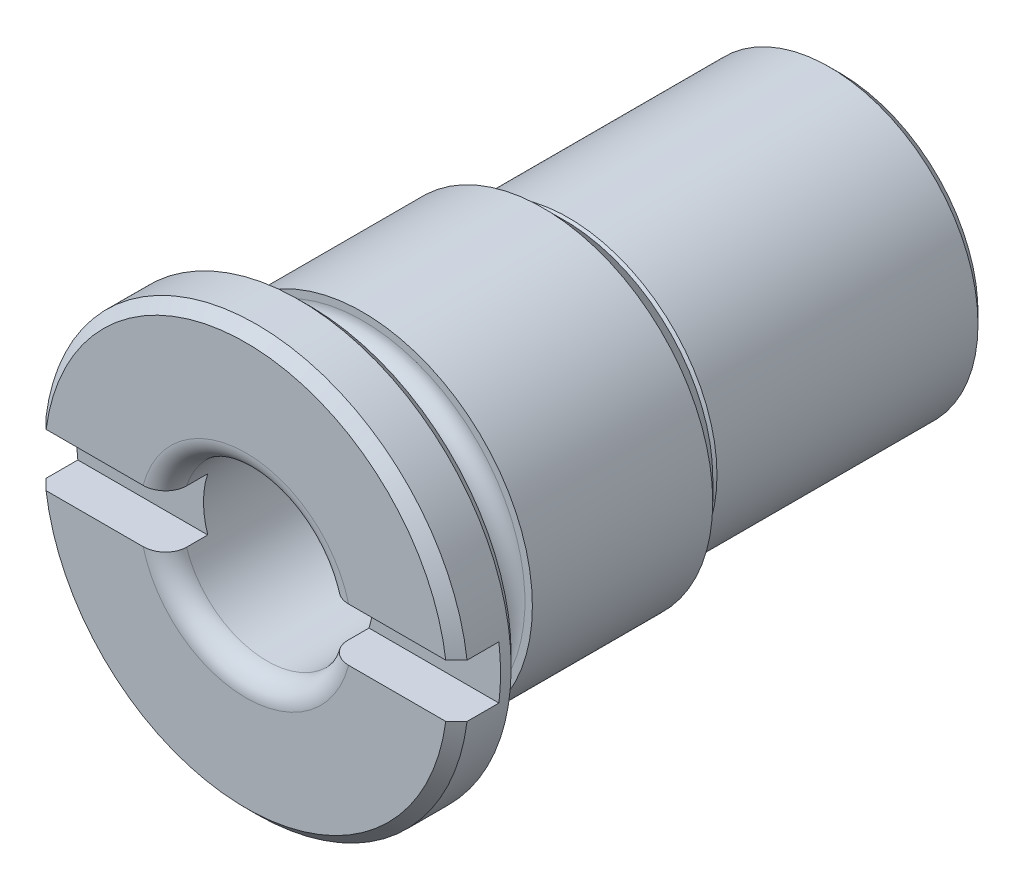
ISO-10303-21;
HEADER;
FILE_DESCRIPTION(('STEP AP214'),'2;1');
FILE_NAME('part.step','',(''),(''),'','','');
FILE_SCHEMA(('AUTOMOTIVE_DESIGN { 1 0 10303 214 1 1 1 1 }'));
ENDSEC;
DATA;
#1=APPLICATION_CONTEXT('core data for automotive mechanical design processes');
#2=APPLICATION_PROTOCOL_DEFINITION('international standard','automotive_design',2000,#1);
#3=PRODUCT_CONTEXT('',#1,'mechanical');
#4=PRODUCT('Part','Part','',(#3));
#5=PRODUCT_RELATED_PRODUCT_CATEGORY('part','',(#4));
#6=PRODUCT_DEFINITION_FORMATION('','',#4);
#7=PRODUCT_DEFINITION_CONTEXT('part definition',#1,'design');
#8=PRODUCT_DEFINITION('design','',#6,#7);
#9=PRODUCT_DEFINITION_SHAPE('','',#8);
#10=(LENGTH_UNIT() NAMED_UNIT(*) SI_UNIT(.MILLI.,.METRE.));
#11=(NAMED_UNIT(*) PLANE_ANGLE_UNIT() SI_UNIT($,.RADIAN.));
#12=(NAMED_UNIT(*) SI_UNIT($,.STERADIAN.) SOLID_ANGLE_UNIT());
#13=UNCERTAINTY_MEASURE_WITH_UNIT(LENGTH_MEASURE(1.E-05),#10,'distance_accuracy_value','');
#14=(GEOMETRIC_REPRESENTATION_CONTEXT(3) GLOBAL_UNCERTAINTY_ASSIGNED_CONTEXT((#13)) GLOBAL_UNIT_ASSIGNED_CONTEXT((#10,
#11,#12)) REPRESENTATION_CONTEXT('',''));
#15=CARTESIAN_POINT('',(0.,0.,0.));
#16=DIRECTION('',(0.,0.,1.));
#17=DIRECTION('',(1.,0.,0.));
#18=AXIS2_PLACEMENT_3D('',#15,#16,#17);
#19=CARTESIAN_POINT('',(-2.87916512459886,1.6622867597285,-14.));
#20=DIRECTION('',(0.,0.,-1.));
#21=DIRECTION('',(0.866025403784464,-0.5,0.));
#22=AXIS2_PLACEMENT_3D('',#19,#20,#21);
#23=SPHERICAL_SURFACE('',#22,1.75);
#24=CARTESIAN_POINT('',(-1.2099080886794,2.18772082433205,-14.));
#25=CARTESIAN_POINT('',(-1.20991191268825,2.18772274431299,-13.9059550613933));
#26=CARTESIAN_POINT('',(-1.2167075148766,2.18400275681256,-13.8118704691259));
#27=CARTESIAN_POINT('',(-1.24359970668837,2.16879960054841,-13.6261779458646));
#28=CARTESIAN_POINT('',(-1.26370935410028,2.15730881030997,-13.5345725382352));
#29=CARTESIAN_POINT('',(-1.31633811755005,2.12560550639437,-13.3563280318));
#30=CARTESIAN_POINT('',(-1.34888458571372,2.1053737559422,-13.2697003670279));
#31=CARTESIAN_POINT('',(-1.42473081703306,2.05480143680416,-13.104493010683));
#32=CARTESIAN_POINT('',(-1.4680185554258,2.02447215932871,-13.025904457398));
#33=CARTESIAN_POINT('',(-1.55321397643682,1.95953405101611,-12.8947188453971));
#34=CARTESIAN_POINT('',(-1.59361208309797,1.9270498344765,-12.8400862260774));
#35=CARTESIAN_POINT('',(-1.67799810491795,1.85403027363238,-12.7396193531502));
#36=CARTESIAN_POINT('',(-1.72198466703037,1.81349795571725,-12.6937818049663));
#37=CARTESIAN_POINT('',(-1.81180993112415,1.7237744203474,-12.6124845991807));
#38=CARTESIAN_POINT('',(-1.85766047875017,1.67451761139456,-12.5771093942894));
#39=CARTESIAN_POINT('',(-1.94830643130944,1.56810724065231,-12.5191754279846));
#40=CARTESIAN_POINT('',(-1.99310291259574,1.51096218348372,-12.4966029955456));
#41=CARTESIAN_POINT('',(-2.07294406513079,1.39891197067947,-12.4678883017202));
#42=CARTESIAN_POINT('',(-2.10847319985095,1.3448268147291,-12.4598783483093));
#43=CARTESIAN_POINT('',(-2.17537594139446,1.23366820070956,-12.4547898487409));
#44=CARTESIAN_POINT('',(-2.20675169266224,1.17659630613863,-12.4577056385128));
#45=CARTESIAN_POINT('',(-2.26198459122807,1.06626409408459,-12.4736020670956));
#46=CARTESIAN_POINT('',(-2.28624969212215,1.01308072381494,-12.4857269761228));
#47=CARTESIAN_POINT('',(-2.33019063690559,0.907460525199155,-12.518479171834));
#48=CARTESIAN_POINT('',(-2.34986625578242,0.855023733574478,-12.5391068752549));
#49=CARTESIAN_POINT('',(-2.38539686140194,0.750369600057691,-12.5890020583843));
#50=CARTESIAN_POINT('',(-2.40107748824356,0.69823692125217,-12.6185690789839));
#51=CARTESIAN_POINT('',(-2.42808080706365,0.597614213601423,-12.6849656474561));
#52=CARTESIAN_POINT('',(-2.43940176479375,0.549125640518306,-12.7217980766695));
#53=CARTESIAN_POINT('',(-2.45956711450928,0.450944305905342,-12.8067162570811));
#54=CARTESIAN_POINT('',(-2.46791810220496,0.401872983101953,-12.8556357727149));
#55=CARTESIAN_POINT('',(-2.48106126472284,0.310589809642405,-12.9599126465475));
#56=CARTESIAN_POINT('',(-2.48585143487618,0.268381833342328,-13.0152736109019));
#57=CARTESIAN_POINT('',(-2.49352519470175,0.185323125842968,-13.1404195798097));
#58=CARTESIAN_POINT('',(-2.4959805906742,0.145772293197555,-13.2110946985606));
#59=CARTESIAN_POINT('',(-2.49903462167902,0.0774384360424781,-13.3575077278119));
#60=CARTESIAN_POINT('',(-2.49963223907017,0.0486613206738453,-13.4332483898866));
#61=CARTESIAN_POINT('',(-2.50013845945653,-0.000663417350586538,-13.5978646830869));
#62=CARTESIAN_POINT('',(-2.49995061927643,-0.0197146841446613,-13.6871918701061));
#63=CARTESIAN_POINT('',(-2.4996513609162,-0.043372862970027,-13.8677419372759));
#64=CARTESIAN_POINT('',(-2.49953996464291,-0.0479756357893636,-13.9589653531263));
#65=CARTESIAN_POINT('',(-2.49964097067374,-0.0425260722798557,-14.1458011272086));
#66=CARTESIAN_POINT('',(-2.49987072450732,-0.0316896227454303,-14.2413917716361));
#67=CARTESIAN_POINT('',(-2.50006285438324,0.00591749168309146,-14.4294424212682));
#68=CARTESIAN_POINT('',(-2.50002510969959,0.0326953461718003,-14.5219009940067));
#69=CARTESIAN_POINT('',(-2.49816987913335,0.101643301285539,-14.7006356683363));
#70=CARTESIAN_POINT('',(-2.49635681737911,0.143774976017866,-14.7869265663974));
#71=CARTESIAN_POINT('',(-2.488695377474,0.24255991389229,-14.9505413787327));
#72=CARTESIAN_POINT('',(-2.48285215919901,0.299194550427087,-15.0278766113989));
#73=CARTESIAN_POINT('',(-2.46653180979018,0.410611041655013,-15.153655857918));
#74=CARTESIAN_POINT('',(-2.45745242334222,0.462747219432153,-15.204632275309));
#75=CARTESIAN_POINT('',(-2.43400618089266,0.573415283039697,-15.2977083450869));
#76=CARTESIAN_POINT('',(-2.41964193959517,0.631943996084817,-15.3398123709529));
#77=CARTESIAN_POINT('',(-2.38439756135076,0.754131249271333,-15.4136497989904));
#78=CARTESIAN_POINT('',(-2.36346909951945,0.817825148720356,-15.4453025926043));
#79=CARTESIAN_POINT('',(-2.31453520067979,0.947472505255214,-15.4960499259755));
#80=CARTESIAN_POINT('',(-2.28653644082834,1.0134237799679,-15.5151562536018));
#81=CARTESIAN_POINT('',(-2.22796909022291,1.13583923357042,-15.5379799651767));
#82=CARTESIAN_POINT('',(-2.19824627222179,1.19239154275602,-15.5434150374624));
#83=CARTESIAN_POINT('',(-2.13451460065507,1.30304092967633,-15.5436996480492));
#84=CARTESIAN_POINT('',(-2.1005075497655,1.3571390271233,-15.538553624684));
#85=CARTESIAN_POINT('',(-2.03195062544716,1.45760910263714,-15.5186733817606));
#86=CARTESIAN_POINT('',(-1.99760045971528,1.5042566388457,-15.5046259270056));
#87=CARTESIAN_POINT('',(-1.92754041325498,1.59304365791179,-15.4682117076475));
#88=CARTESIAN_POINT('',(-1.89183040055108,1.63518270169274,-15.4458441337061));
#89=CARTESIAN_POINT('',(-1.81854121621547,1.71640646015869,-15.3923144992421));
#90=CARTESIAN_POINT('',(-1.78095797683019,1.75523261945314,-15.3607681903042));
#91=CARTESIAN_POINT('',(-1.70707429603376,1.8271731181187,-15.2905087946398));
#92=CARTESIAN_POINT('',(-1.67077437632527,1.86028515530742,-15.2517928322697));
#93=CARTESIAN_POINT('',(-1.59598281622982,1.92499369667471,-15.1627220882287));
#94=CARTESIAN_POINT('',(-1.55784084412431,1.955804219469,-15.1115043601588));
#95=CARTESIAN_POINT('',(-1.48612579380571,2.01084009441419,-15.0027272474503));
#96=CARTESIAN_POINT('',(-1.45255587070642,2.03506091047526,-14.9451635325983));
#97=CARTESIAN_POINT('',(-1.38616839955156,2.08096652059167,-14.8154126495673));
#98=CARTESIAN_POINT('',(-1.35433145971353,2.10162474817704,-14.7423596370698));
#99=CARTESIAN_POINT('',(-1.29957831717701,2.13591733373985,-14.5914551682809));
#100=CARTESIAN_POINT('',(-1.27666196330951,2.14955181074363,-14.5136037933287));
#101=CARTESIAN_POINT('',(-1.24253877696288,2.16943341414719,-14.3634731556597));
#102=CARTESIAN_POINT('',(-1.23033328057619,2.17632021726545,-14.291502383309));
#103=CARTESIAN_POINT('',(-1.21401604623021,2.18546340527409,-14.1463624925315));
#104=CARTESIAN_POINT('',(-1.20990511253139,2.18771933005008,-14.0731932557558));
#105=CARTESIAN_POINT('',(-1.2099080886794,2.18772082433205,-14.));
#106=B_SPLINE_CURVE_WITH_KNOTS('',3,(#24,#25,#26,#27,#28,#29,#30,#31,#32,#33,#34,#35,#36,#37,
#38,#39,#40,#41,#42,#43,#44,#45,#46,#47,#48,#49,#50,#51,#52,#53,#54,#55,#56,#57,#58,#59,#60,#61,
#62,#63,#64,#65,#66,#67,#68,#69,#70,#71,#72,#73,#74,#75,#76,#77,#78,#79,#80,#81,#82,#83,#84,#85,
#86,#87,#88,#89,#90,#91,#92,#93,#94,#95,#96,#97,#98,#99,#100,#101,#102,#103,#104,#105),
.UNSPECIFIED.,.T.,.F.,(4,2,2,2,2,2,2,2,2,2,2,2,2,2,2,2,2,2,2,2,2,2,2,2,2,2,2,2,2,2,2,2,2,2,2,2,
2,2,2,2,4),(0.,0.281885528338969,0.564047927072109,0.846834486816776,1.12930588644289,
1.35433308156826,1.57927581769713,1.80598763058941,2.03245689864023,2.2269984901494,
2.42143924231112,2.59973661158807,2.7780427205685,2.96315008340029,3.14833100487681,
3.3569011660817,3.56558865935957,3.80769723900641,4.04993841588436,4.32274224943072,
4.59562422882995,4.88286916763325,5.17024375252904,5.45690401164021,5.74319793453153,
5.96275344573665,6.18220047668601,6.40330254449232,6.62419658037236,6.81551999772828,
7.00676317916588,7.18479797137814,7.3628500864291,7.5498168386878,7.73685874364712,
7.94875359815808,8.16079394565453,8.40677620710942,8.65275429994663,8.8721182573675,
9.09150400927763),.UNSPECIFIED.);
#107=CARTESIAN_POINT('',(-1.2099080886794,2.18772082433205,-14.));
#108=VERTEX_POINT('',#107);
#109=EDGE_CURVE('E29',#108,#108,#106,.T.);
#110=ORIENTED_EDGE('',*,*,#109,.T.);
#111=EDGE_LOOP('',(#110));
#112=FACE_BOUND('',#111,.T.);
#113=ADVANCED_FACE('F14',(#112),#23,.T.);
#114=CARTESIAN_POINT('',(0.,-3.32457351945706,-14.));
#115=DIRECTION('',(0.,0.,-1.));
#116=DIRECTION('',(0.,1.00000000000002,0.));
#117=AXIS2_PLACEMENT_3D('',#114,#115,#116);
#118=SPHERICAL_SURFACE('',#117,1.75);
#119=CARTESIAN_POINT('',(-1.28966776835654,-2.14167153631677,-14.));
#120=CARTESIAN_POINT('',(-1.28966751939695,-2.14167580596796,-13.905955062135));
#121=CARTESIAN_POINT('',(-1.28304811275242,-2.14570099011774,-13.8118704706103));
#122=CARTESIAN_POINT('',(-1.25643569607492,-2.16138874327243,-13.6261779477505));
#123=CARTESIAN_POINT('',(-1.2364295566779,-2.17305880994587,-13.5345725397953));
#124=CARTESIAN_POINT('',(-1.18265930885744,-2.20278500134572,-13.3563280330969));
#125=CARTESIAN_POINT('',(-1.14886486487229,-2.22085519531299,-13.2697003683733));
#126=CARTESIAN_POINT('',(-1.06714483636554,-2.26125379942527,-13.1044930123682));
#127=CARTESIAN_POINT('',(-1.019235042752,-2.2835774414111,-13.0259044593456));
#128=CARTESIAN_POINT('',(-0.920399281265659,-2.32488978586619,-12.8947188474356));
#129=CARTESIAN_POINT('',(-0.872068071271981,-2.3436334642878,-12.8400862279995));
#130=CARTESIAN_POINT('',(-0.766638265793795,-2.38020412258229,-12.7396193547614));
#131=CARTESIAN_POINT('',(-0.709542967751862,-2.39803144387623,-12.6937818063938));
#132=CARTESIAN_POINT('',(-0.58692747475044,-2.43096063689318,-12.6124846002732));
#133=CARTESIAN_POINT('',(-0.521344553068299,-2.44603997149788,-12.5771093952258));
#134=CARTESIAN_POINT('',(-0.38386749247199,-2.47133648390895,-12.519175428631));
#135=CARTESIAN_POINT('',(-0.311980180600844,-2.48155884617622,-12.4966029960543));
#136=CARTESIAN_POINT('',(-0.175021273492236,-2.49467820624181,-12.4678883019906));
#137=CARTESIAN_POINT('',(-0.110417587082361,-2.49840476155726,-12.4598783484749));
#138=CARTESIAN_POINT('',(0.0192999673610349,-2.500764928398,-12.4547898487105));
#139=CARTESIAN_POINT('',(0.0844135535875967,-2.49940117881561,-12.4577056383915));
#140=CARTESIAN_POINT('',(0.207580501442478,-2.49206816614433,-12.4736020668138));
#141=CARTESIAN_POINT('',(0.265771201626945,-2.48649067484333,-12.4857269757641));
#142=CARTESIAN_POINT('',(0.379211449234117,-2.47173455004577,-12.5184791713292));
#143=CARTESIAN_POINT('',(0.434460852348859,-2.46255574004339,-12.5391068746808));
#144=CARTESIAN_POINT('',(0.542859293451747,-2.44099908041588,-12.5890020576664));
#145=CARTESIAN_POINT('',(0.595847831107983,-2.42851256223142,-12.618569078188));
#146=CARTESIAN_POINT('',(0.696491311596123,-2.40158676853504,-12.684965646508));
#147=CARTESIAN_POINT('',(0.744144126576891,-2.38714671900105,-12.7217980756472));
#148=CARTESIAN_POINT('',(0.839254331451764,-2.35551975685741,-12.8067162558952));
#149=CARTESIAN_POINT('',(0.885926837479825,-2.3382162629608,-12.8556357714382));
#150=CARTESIAN_POINT('',(0.971551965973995,-2.30395698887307,-12.9599126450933));
#151=CARTESIAN_POINT('',(1.01050023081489,-2.28700140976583,-13.0152736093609));
#152=CARTESIAN_POINT('',(1.08626806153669,-2.2521177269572,-13.1404195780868));
#153=CARTESIAN_POINT('',(1.12174778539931,-2.23446874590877,-13.2110946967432));
#154=CARTESIAN_POINT('',(1.18245365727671,-2.20294668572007,-13.3575077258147));
#155=CARTESIAN_POINT('',(1.20767417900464,-2.18907567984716,-13.433248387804));
#156=CARTESIAN_POINT('',(1.25064376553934,-2.16485171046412,-13.5978646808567));
#157=CARTESIAN_POINT('',(1.26704872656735,-2.15516340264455,-13.6871918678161));
#158=CARTESIAN_POINT('',(1.28738768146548,-2.14307514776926,-13.8677419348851));
#159=CARTESIAN_POINT('',(1.29131810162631,-2.14067728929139,-13.9589653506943));
#160=CARTESIAN_POINT('',(1.28664914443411,-2.14348954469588,-14.1458011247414));
#161=CARTESIAN_POINT('',(1.27737938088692,-2.14910674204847,-14.2413917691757));
#162=CARTESIAN_POINT('',(1.24490672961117,-2.16807668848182,-14.4294424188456));
#163=CARTESIAN_POINT('',(1.22169755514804,-2.18143292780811,-14.5219009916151));
#164=CARTESIAN_POINT('',(1.16105925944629,-2.21430022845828,-14.7006356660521));
#165=CARTESIAN_POINT('',(1.123665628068,-2.23379590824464,-14.7869265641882));
#166=CARTESIAN_POINT('',(1.03428464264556,-2.27655337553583,-14.9505413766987));
#167=CARTESIAN_POINT('',(0.982315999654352,-2.29981031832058,-15.027876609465));
#168=CARTESIAN_POINT('',(0.877666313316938,-2.34138472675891,-15.1536558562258));
#169=CARTESIAN_POINT('',(0.827975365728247,-2.35958983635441,-15.2046322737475));
#170=CARTESIAN_POINT('',(0.720410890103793,-2.39461882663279,-15.297708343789));
#171=CARTESIAN_POINT('',(0.662541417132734,-2.4114433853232,-15.3398123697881));
#172=CARTESIAN_POINT('',(0.539101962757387,-2.44201448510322,-15.4136497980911));
#173=CARTESIAN_POINT('',(0.473477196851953,-2.45573685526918,-15.4453025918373));
#174=CARTESIAN_POINT('',(0.336732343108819,-2.47818253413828,-15.4960499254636));
#175=CARTESIAN_POINT('',(0.265617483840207,-2.48691053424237,-15.5151562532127));
#176=CARTESIAN_POINT('',(0.130318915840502,-2.49739744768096,-15.5379799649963));
#177=CARTESIAN_POINT('',(0.0664817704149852,-2.49993288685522,-15.5434150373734));
#178=CARTESIAN_POINT('',(-0.0612092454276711,-2.50006433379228,-15.5436996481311));
#179=CARTESIAN_POINT('',(-0.12506309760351,-2.49766241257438,-15.5385536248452));
#180=CARTESIAN_POINT('',(-0.24635119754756,-2.48852541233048,-15.5186733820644));
#181=CARTESIAN_POINT('',(-0.303924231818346,-2.48210106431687,-15.5046259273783));
#182=CARTESIAN_POINT('',(-0.415846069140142,-2.46582079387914,-15.4682117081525));
#183=CARTESIAN_POINT('',(-0.47019455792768,-2.4559645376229,-15.4458441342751));
#184=CARTESIAN_POINT('',(-0.577180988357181,-2.43310612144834,-15.3923144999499));
#185=CARTESIAN_POINT('',(-0.629597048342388,-2.41997116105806,-15.3607681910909));
#186=CARTESIAN_POINT('',(-0.728841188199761,-2.39195626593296,-15.290508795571));
#187=CARTESIAN_POINT('',(-0.775667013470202,-2.3770756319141,-15.2517928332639));
#188=CARTESIAN_POINT('',(-0.869102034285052,-2.34465851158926,-15.1627220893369));
#189=CARTESIAN_POINT('',(-0.914855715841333,-2.32703185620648,-15.1115043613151));
#190=CARTESIAN_POINT('',(-0.998375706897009,-2.29244273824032,-15.0027272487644));
#191=CARTESIAN_POINT('',(-1.03613651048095,-2.27548074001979,-14.9451635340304));
#192=CARTESIAN_POINT('',(-1.10908567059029,-2.24094030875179,-14.8154126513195));
#193=CARTESIAN_POINT('',(-1.14289469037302,-2.22369782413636,-14.74235963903));
#194=CARTESIAN_POINT('',(-1.1999695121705,-2.19342650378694,-14.5914551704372));
#195=CARTESIAN_POINT('',(-1.22323549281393,-2.1803975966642,-14.513603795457));
#196=CARTESIAN_POINT('',(-1.25751505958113,-2.16078685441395,-14.3634731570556));
#197=CARTESIAN_POINT('',(-1.26958195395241,-2.15365998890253,-14.2915023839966));
#198=CARTESIAN_POINT('',(-1.28565880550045,-2.14410043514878,-14.1463624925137));
#199=CARTESIAN_POINT('',(-1.28966796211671,-2.14166821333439,-14.0731932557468));
#200=CARTESIAN_POINT('',(-1.28966776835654,-2.14167153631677,-14.));
#201=B_SPLINE_CURVE_WITH_KNOTS('',3,(#119,#120,#121,#122,#123,#124,#125,#126,#127,#128,#129,
#130,#131,#132,#133,#134,#135,#136,#137,#138,#139,#140,#141,#142,#143,#144,#145,#146,#147,#148,
#149,#150,#151,#152,#153,#154,#155,#156,#157,#158,#159,#160,#161,#162,#163,#164,#165,#166,#167,
#168,#169,#170,#171,#172,#173,#174,#175,#176,#177,#178,#179,#180,#181,#182,#183,#184,#185,#186,
#187,#188,#189,#190,#191,#192,#193,#194,#195,#196,#197,#198,#199,#200),.UNSPECIFIED.,.T.,.F.,(4,
2,2,2,2,2,2,2,2,2,2,2,2,2,2,2,2,2,2,2,2,2,2,2,2,2,2,2,2,2,2,2,2,2,2,2,2,2,2,2,4),(0.,
0.281885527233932,0.564047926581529,0.846834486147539,1.12930588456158,1.35433307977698,
1.57927581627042,1.80598762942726,2.03245689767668,2.22699848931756,2.42143924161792,
2.59973661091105,2.77804271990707,2.96315008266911,3.14833100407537,3.35690116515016,
3.56558865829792,3.80769723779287,4.04993841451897,4.32274224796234,4.59562422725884,
4.88286916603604,5.17024375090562,5.45690401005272,5.74319793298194,5.96275344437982,
6.18220047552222,6.40330254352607,6.62419657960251,6.81551999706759,7.0067631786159,
7.18479797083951,7.36285008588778,7.54981683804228,7.73685874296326,7.94875359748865,
8.16079394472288,8.40677620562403,8.6527542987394,8.87211825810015,9.0915040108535),.UNSPECIFIED.);
#202=CARTESIAN_POINT('',(-1.28966776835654,-2.14167153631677,-14.));
#203=VERTEX_POINT('',#202);
#204=EDGE_CURVE('E362',#203,#203,#201,.T.);
#205=ORIENTED_EDGE('',*,*,#204,.T.);
#206=EDGE_LOOP('',(#205));
#207=FACE_BOUND('',#206,.T.);
#208=ADVANCED_FACE('F327',(#207),#118,.T.);
#209=CARTESIAN_POINT('',(0.,0.,-4.));
#210=DIRECTION('',(0.,0.,1.));
#211=DIRECTION('',(-1.,0.,0.));
#212=AXIS2_PLACEMENT_3D('',#209,#210,#211);
#213=CYLINDRICAL_SURFACE('',#212,4.);
#214=CARTESIAN_POINT('',(0.,0.,-25.5));
#215=DIRECTION('',(0.,0.,1.));
#216=DIRECTION('',(-1.,0.,0.));
#217=AXIS2_PLACEMENT_3D('',#214,#215,#216);
#218=CIRCLE('',#217,4.);
#219=CARTESIAN_POINT('',(-4.,0.,-25.5));
#220=VERTEX_POINT('',#219);
#221=EDGE_CURVE('E139',#220,#220,#218,.T.);
#222=ORIENTED_EDGE('',*,*,#221,.T.);
#223=EDGE_LOOP('',(#222));
#224=FACE_BOUND('',#223,.T.);
#225=CARTESIAN_POINT('',(0.,0.,-24.4));
#226=DIRECTION('',(0.,0.,1.));
#227=DIRECTION('',(-1.,0.,0.));
#228=AXIS2_PLACEMENT_3D('',#225,#226,#227);
#229=CIRCLE('',#228,4.);
#230=CARTESIAN_POINT('',(-4.,0.,-24.4));
#231=VERTEX_POINT('',#230);
#232=EDGE_CURVE('E143',#231,#231,#229,.F.);
#233=ORIENTED_EDGE('',*,*,#232,.T.);
#234=EDGE_LOOP('',(#233));
#235=FACE_BOUND('',#234,.T.);
#236=ADVANCED_FACE('F309',(#224,#235),#213,.T.);
#237=CARTESIAN_POINT('',(0.,0.,-25.5));
#238=DIRECTION('',(0.,0.,1.));
#239=DIRECTION('',(-1.,0.,0.));
#240=AXIS2_PLACEMENT_3D('',#237,#238,#239);
#241=CONICAL_SURFACE('',#240,4.,0.785398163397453);
#242=CARTESIAN_POINT('',(0.,0.,-26.));
#243=DIRECTION('',(0.,0.,1.));
#244=DIRECTION('',(-1.,0.,0.));
#245=AXIS2_PLACEMENT_3D('',#242,#243,#244);
#246=CIRCLE('',#245,3.5);
#247=CARTESIAN_POINT('',(-3.5,0.,-26.));
#248=VERTEX_POINT('',#247);
#249=EDGE_CURVE('E134',#248,#248,#246,.F.);
#250=ORIENTED_EDGE('',*,*,#249,.F.);
#251=EDGE_LOOP('',(#250));
#252=FACE_BOUND('',#251,.T.);
#253=ORIENTED_EDGE('',*,*,#221,.F.);
#254=EDGE_LOOP('',(#253));
#255=FACE_BOUND('',#254,.T.);
#256=ADVANCED_FACE('F312',(#252,#255),#241,.T.);
#257=CARTESIAN_POINT('',(0.,-1.65,-26.));
#258=DIRECTION('',(0.,0.,1.));
#259=DIRECTION('',(-1.,0.,0.));
#260=AXIS2_PLACEMENT_3D('',#257,#258,#259);
#261=PLANE('',#260);
#262=CARTESIAN_POINT('',(0.,0.,-26.));
#263=DIRECTION('',(0.,0.,1.));
#264=DIRECTION('',(-1.,0.,0.));
#265=AXIS2_PLACEMENT_3D('',#262,#263,#264);
#266=CIRCLE('',#265,2.5);
#267=CARTESIAN_POINT('',(-2.5,0.,-26.));
#268=VERTEX_POINT('',#267);
#269=EDGE_CURVE('E281',#268,#268,#266,.T.);
#270=ORIENTED_EDGE('',*,*,#269,.T.);
#271=EDGE_LOOP('',(#270));
#272=FACE_BOUND('',#271,.T.);
#273=ORIENTED_EDGE('',*,*,#249,.T.);
#274=EDGE_LOOP('',(#273));
#275=FACE_BOUND('',#274,.T.);
#276=ADVANCED_FACE('F314',(#272,#275),#261,.F.);
#277=CARTESIAN_POINT('',(0.,0.,-4.));
#278=DIRECTION('',(0.,0.,1.));
#279=DIRECTION('',(-1.,0.,0.));
#280=AXIS2_PLACEMENT_3D('',#277,#278,#279);
#281=CYLINDRICAL_SURFACE('',#280,2.5);
#282=CARTESIAN_POINT('',(1.20990808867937,2.18772082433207,-14.));
#283=CARTESIAN_POINT('',(1.20991191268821,2.18772274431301,-14.0940449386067));
#284=CARTESIAN_POINT('',(1.21670751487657,2.18400275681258,-14.1881295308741));
#285=CARTESIAN_POINT('',(1.24359970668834,2.16879960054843,-14.3738220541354));
#286=CARTESIAN_POINT('',(1.26370935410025,2.15730881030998,-14.4654274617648));
#287=CARTESIAN_POINT('',(1.31633811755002,2.12560550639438,-14.6436719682));
#288=CARTESIAN_POINT('',(1.3488845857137,2.10537375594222,-14.7302996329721));
#289=CARTESIAN_POINT('',(1.42473081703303,2.05480143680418,-14.895506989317));
#290=CARTESIAN_POINT('',(1.46801855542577,2.02447215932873,-14.974095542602));
#291=CARTESIAN_POINT('',(1.55321397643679,1.95953405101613,-15.1052811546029));
#292=CARTESIAN_POINT('',(1.59361208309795,1.92704983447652,-15.1599137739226));
#293=CARTESIAN_POINT('',(1.67799810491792,1.8540302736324,-15.2603806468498));
#294=CARTESIAN_POINT('',(1.72198466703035,1.81349795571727,-15.3062181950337));
#295=CARTESIAN_POINT('',(1.81180993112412,1.72377442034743,-15.3875154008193));
#296=CARTESIAN_POINT('',(1.85766047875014,1.67451761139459,-15.4228906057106));
#297=CARTESIAN_POINT('',(1.94830643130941,1.56810724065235,-15.4808245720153));
#298=CARTESIAN_POINT('',(1.99310291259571,1.51096218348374,-15.5033970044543));
#299=CARTESIAN_POINT('',(2.07294406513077,1.3989119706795,-15.5321116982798));
#300=CARTESIAN_POINT('',(2.10847319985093,1.34482681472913,-15.5401216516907));
#301=CARTESIAN_POINT('',(2.17537594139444,1.2336682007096,-15.5452101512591));
#302=CARTESIAN_POINT('',(2.20675169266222,1.17659630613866,-15.5422943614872));
#303=CARTESIAN_POINT('',(2.26198459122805,1.06626409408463,-15.5263979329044));
#304=CARTESIAN_POINT('',(2.28624969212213,1.01308072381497,-15.5142730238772));
#305=CARTESIAN_POINT('',(2.33019063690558,0.907460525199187,-15.481520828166));
#306=CARTESIAN_POINT('',(2.34986625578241,0.855023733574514,-15.4608931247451));
#307=CARTESIAN_POINT('',(2.38539686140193,0.75036960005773,-15.4109979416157));
#308=CARTESIAN_POINT('',(2.40107748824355,0.698236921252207,-15.3814309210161));
#309=CARTESIAN_POINT('',(2.42808080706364,0.597614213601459,-15.3150343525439));
#310=CARTESIAN_POINT('',(2.43940176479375,0.549125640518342,-15.2782019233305));
#311=CARTESIAN_POINT('',(2.45956711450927,0.450944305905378,-15.1932837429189));
#312=CARTESIAN_POINT('',(2.46791810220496,0.401872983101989,-15.1443642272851));
#313=CARTESIAN_POINT('',(2.48106126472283,0.310589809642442,-15.0400873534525));
#314=CARTESIAN_POINT('',(2.48585143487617,0.268381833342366,-14.9847263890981));
#315=CARTESIAN_POINT('',(2.49352519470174,0.185323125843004,-14.8595804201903));
#316=CARTESIAN_POINT('',(2.4959805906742,0.145772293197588,-14.7889053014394));
#317=CARTESIAN_POINT('',(2.49903462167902,0.0774384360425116,-14.6424922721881));
#318=CARTESIAN_POINT('',(2.49963223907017,0.0486613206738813,-14.5667516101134));
#319=CARTESIAN_POINT('',(2.50013845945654,-0.000663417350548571,-14.4021353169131));
#320=CARTESIAN_POINT('',(2.49995061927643,-0.019714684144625,-14.3128081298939));
#321=CARTESIAN_POINT('',(2.4996513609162,-0.0433728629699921,-14.1322580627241));
#322=CARTESIAN_POINT('',(2.49953996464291,-0.0479756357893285,-14.0410346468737));
#323=CARTESIAN_POINT('',(2.49964097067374,-0.0425260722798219,-13.8541988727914));
#324=CARTESIAN_POINT('',(2.49987072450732,-0.031689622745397,-13.7586082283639));
#325=CARTESIAN_POINT('',(2.50006285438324,0.00591749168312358,-13.5705575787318));
#326=CARTESIAN_POINT('',(2.50002510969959,0.0326953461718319,-13.4780990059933));
#327=CARTESIAN_POINT('',(2.49816987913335,0.101643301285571,-13.2993643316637));
#328=CARTESIAN_POINT('',(2.4963568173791,0.143774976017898,-13.2130734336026));
#329=CARTESIAN_POINT('',(2.488695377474,0.242559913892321,-13.0494586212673));
#330=CARTESIAN_POINT('',(2.48285215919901,0.299194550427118,-12.9721233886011));
#331=CARTESIAN_POINT('',(2.46653180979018,0.410611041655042,-12.8463441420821));
#332=CARTESIAN_POINT('',(2.45745242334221,0.462747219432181,-12.795367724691));
#333=CARTESIAN_POINT('',(2.43400618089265,0.573415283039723,-12.7022916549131));
#334=CARTESIAN_POINT('',(2.41964193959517,0.631943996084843,-12.6601876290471));
#335=CARTESIAN_POINT('',(2.38439756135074,0.754131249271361,-12.5863502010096));
#336=CARTESIAN_POINT('',(2.36346909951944,0.817825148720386,-12.5546974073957));
#337=CARTESIAN_POINT('',(2.31453520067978,0.947472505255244,-12.5039500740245));
#338=CARTESIAN_POINT('',(2.28653644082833,1.01342377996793,-12.4848437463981));
#339=CARTESIAN_POINT('',(2.2279690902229,1.13583923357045,-12.4620200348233));
#340=CARTESIAN_POINT('',(2.19824627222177,1.19239154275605,-12.4565849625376));
#341=CARTESIAN_POINT('',(2.13451460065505,1.30304092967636,-12.4563003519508));
#342=CARTESIAN_POINT('',(2.10050754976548,1.35713902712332,-12.461446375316));
#343=CARTESIAN_POINT('',(2.03195062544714,1.45760910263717,-12.4813266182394));
#344=CARTESIAN_POINT('',(1.99760045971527,1.50425663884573,-12.4953740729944));
#345=CARTESIAN_POINT('',(1.92754041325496,1.59304365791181,-12.5317882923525));
#346=CARTESIAN_POINT('',(1.89183040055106,1.63518270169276,-12.5541558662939));
#347=CARTESIAN_POINT('',(1.81854121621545,1.71640646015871,-12.6076855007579));
#348=CARTESIAN_POINT('',(1.78095797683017,1.75523261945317,-12.6392318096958));
#349=CARTESIAN_POINT('',(1.70707429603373,1.82717311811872,-12.7094912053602));
#350=CARTESIAN_POINT('',(1.67077437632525,1.86028515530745,-12.7482071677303));
#351=CARTESIAN_POINT('',(1.5959828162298,1.92499369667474,-12.8372779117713));
#352=CARTESIAN_POINT('',(1.55784084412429,1.95580421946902,-12.8884956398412));
#353=CARTESIAN_POINT('',(1.48612579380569,2.01084009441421,-12.9972727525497));
#354=CARTESIAN_POINT('',(1.4525558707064,2.03506091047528,-13.0548364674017));
#355=CARTESIAN_POINT('',(1.38616839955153,2.08096652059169,-13.1845873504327));
#356=CARTESIAN_POINT('',(1.3543314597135,2.10162474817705,-13.2576403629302));
#357=CARTESIAN_POINT('',(1.29957831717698,2.13591733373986,-13.4085448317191));
#358=CARTESIAN_POINT('',(1.27666196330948,2.14955181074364,-13.4863962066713));
#359=CARTESIAN_POINT('',(1.24253877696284,2.1694334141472,-13.6365268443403));
#360=CARTESIAN_POINT('',(1.23033328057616,2.17632021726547,-13.708497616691));
#361=CARTESIAN_POINT('',(1.21401604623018,2.18546340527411,-13.8536375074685));
#362=CARTESIAN_POINT('',(1.20990511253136,2.1877193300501,-13.9268067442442));
#363=CARTESIAN_POINT('',(1.20990808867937,2.18772082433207,-14.));
#364=B_SPLINE_CURVE_WITH_KNOTS('',3,(#282,#283,#284,#285,#286,#287,#288,#289,#290,#291,#292,
#293,#294,#295,#296,#297,#298,#299,#300,#301,#302,#303,#304,#305,#306,#307,#308,#309,#310,#311,
#312,#313,#314,#315,#316,#317,#318,#319,#320,#321,#322,#323,#324,#325,#326,#327,#328,#329,#330,
#331,#332,#333,#334,#335,#336,#337,#338,#339,#340,#341,#342,#343,#344,#345,#346,#347,#348,#349,
#350,#351,#352,#353,#354,#355,#356,#357,#358,#359,#360,#361,#362,#363),.UNSPECIFIED.,.T.,.F.,(4,
2,2,2,2,2,2,2,2,2,2,2,2,2,2,2,2,2,2,2,2,2,2,2,2,2,2,2,2,2,2,2,2,2,2,2,2,2,2,2,4),(0.,
0.281885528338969,0.56404792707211,0.84683448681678,1.12930588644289,1.35433308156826,
1.57927581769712,1.8059876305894,2.03245689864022,2.22699849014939,2.42143924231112,
2.59973661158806,2.77804272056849,2.96315008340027,3.1483310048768,3.35690116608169,
3.56558865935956,3.8076972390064,4.04993841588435,4.3227422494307,4.59562422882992,
4.88286916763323,5.17024375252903,5.45690401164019,5.74319793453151,5.96275344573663,
6.182200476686,6.40330254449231,6.62419658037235,6.81551999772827,7.00676317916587,
7.18479797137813,7.36285008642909,7.54981683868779,7.73685874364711,7.94875359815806,
8.1607939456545,8.4067762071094,8.65275429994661,8.87211825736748,9.09150400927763),.UNSPECIFIED.);
#365=CARTESIAN_POINT('',(1.20990808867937,2.18772082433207,-14.));
#366=VERTEX_POINT('',#365);
#367=EDGE_CURVE('E9',#366,#366,#364,.T.);
#368=ORIENTED_EDGE('',*,*,#367,.F.);
#369=EDGE_LOOP('',(#368));
#370=FACE_BOUND('',#369,.T.);
#371=ORIENTED_EDGE('',*,*,#109,.F.);
#372=EDGE_LOOP('',(#371));
#373=FACE_BOUND('',#372,.T.);
#374=ORIENTED_EDGE('',*,*,#204,.F.);
#375=EDGE_LOOP('',(#374));
#376=FACE_BOUND('',#375,.T.);
#377=CARTESIAN_POINT('',(0.,0.,-10.5));
#378=DIRECTION('',(0.,0.,1.));
#379=DIRECTION('',(0.,1.,0.));
#380=AXIS2_PLACEMENT_3D('',#377,#378,#379);
#381=CIRCLE('',#380,2.5);
#382=CARTESIAN_POINT('',(0.,2.5,-10.5));
#383=VERTEX_POINT('',#382);
#384=EDGE_CURVE('E153',#383,#383,#381,.F.);
#385=ORIENTED_EDGE('',*,*,#384,.F.);
#386=EDGE_LOOP('',(#385));
#387=FACE_BOUND('',#386,.T.);
#388=ORIENTED_EDGE('',*,*,#269,.F.);
#389=EDGE_LOOP('',(#388));
#390=FACE_BOUND('',#389,.T.);
#391=ADVANCED_FACE('F323',(#370,#373,#376,#387,#390),#281,.F.);
#392=CARTESIAN_POINT('',(0.,-4.,-10.5));
#393=DIRECTION('',(0.,0.,1.));
#394=DIRECTION('',(0.,1.,0.));
#395=AXIS2_PLACEMENT_3D('',#392,#393,#394);
#396=PLANE('',#395);
#397=CARTESIAN_POINT('',(0.,0.,-10.5));
#398=DIRECTION('',(0.,0.,1.));
#399=DIRECTION('',(0.,1.,0.));
#400=AXIS2_PLACEMENT_3D('',#397,#398,#399);
#401=CIRCLE('',#400,4.);
#402=CARTESIAN_POINT('',(0.,4.,-10.5));
#403=VERTEX_POINT('',#402);
#404=EDGE_CURVE('E157',#403,#403,#401,.T.);
#405=ORIENTED_EDGE('',*,*,#404,.T.);
#406=EDGE_LOOP('',(#405));
#407=FACE_BOUND('',#406,.T.);
#408=ORIENTED_EDGE('',*,*,#384,.T.);
#409=EDGE_LOOP('',(#408));
#410=FACE_BOUND('',#409,.T.);
#411=ADVANCED_FACE('F371',(#407,#410),#396,.T.);
#412=CARTESIAN_POINT('',(0.,0.,3.));
#413=DIRECTION('',(0.,0.,1.));
#414=DIRECTION('',(0.,1.,0.));
#415=AXIS2_PLACEMENT_3D('',#412,#413,#414);
#416=CYLINDRICAL_SURFACE('',#415,4.);
#417=DIRECTION('',(0.,0.,1.));
#418=VECTOR('',#417,1.);
#419=CARTESIAN_POINT('',(-3.79967103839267,-1.25,3.));
#420=LINE('',#419,#418);
#421=CARTESIAN_POINT('',(-3.79967103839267,-1.25,2.));
#422=VERTEX_POINT('',#421);
#423=CARTESIAN_POINT('',(-3.79967103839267,-1.25,1.));
#424=VERTEX_POINT('',#423);
#425=EDGE_CURVE('E160',#422,#424,#420,.F.);
#426=ORIENTED_EDGE('',*,*,#425,.F.);
#427=CARTESIAN_POINT('',(0.,0.,2.));
#428=DIRECTION('',(0.,0.,1.));
#429=DIRECTION('',(-1.,0.,0.));
#430=AXIS2_PLACEMENT_3D('',#427,#428,#429);
#431=CIRCLE('',#430,4.);
#432=CARTESIAN_POINT('',(3.79967103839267,-1.25,2.));
#433=VERTEX_POINT('',#432);
#434=EDGE_CURVE('E173',#422,#433,#431,.T.);
#435=ORIENTED_EDGE('',*,*,#434,.T.);
#436=DIRECTION('',(0.,0.,1.));
#437=VECTOR('',#436,1.);
#438=CARTESIAN_POINT('',(3.79967103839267,-1.25,3.));
#439=LINE('',#438,#437);
#440=CARTESIAN_POINT('',(3.79967103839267,-1.25,1.));
#441=VERTEX_POINT('',#440);
#442=EDGE_CURVE('E165',#441,#433,#439,.T.);
#443=ORIENTED_EDGE('',*,*,#442,.F.);
#444=CARTESIAN_POINT('',(0.,0.,1.));
#445=DIRECTION('',(0.,0.,1.));
#446=DIRECTION('',(-1.,0.,0.));
#447=AXIS2_PLACEMENT_3D('',#444,#445,#446);
#448=CIRCLE('',#447,4.);
#449=CARTESIAN_POINT('',(3.79967103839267,1.25,1.));
#450=VERTEX_POINT('',#449);
#451=EDGE_CURVE('E161',#441,#450,#448,.T.);
#452=ORIENTED_EDGE('',*,*,#451,.T.);
#453=DIRECTION('',(0.,0.,1.));
#454=VECTOR('',#453,1.);
#455=CARTESIAN_POINT('',(3.79967103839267,1.25,3.));
#456=LINE('',#455,#454);
#457=CARTESIAN_POINT('',(3.79967103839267,1.25,2.));
#458=VERTEX_POINT('',#457);
#459=EDGE_CURVE('E168',#458,#450,#456,.F.);
#460=ORIENTED_EDGE('',*,*,#459,.F.);
#461=CARTESIAN_POINT('',(0.,0.,2.));
#462=DIRECTION('',(0.,0.,1.));
#463=DIRECTION('',(-1.,0.,0.));
#464=AXIS2_PLACEMENT_3D('',#461,#462,#463);
#465=CIRCLE('',#464,4.);
#466=CARTESIAN_POINT('',(-3.79967103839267,1.25,2.));
#467=VERTEX_POINT('',#466);
#468=EDGE_CURVE('E170',#458,#467,#465,.T.);
#469=ORIENTED_EDGE('',*,*,#468,.T.);
#470=DIRECTION('',(0.,0.,1.));
#471=VECTOR('',#470,1.);
#472=CARTESIAN_POINT('',(-3.79967103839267,1.25,3.));
#473=LINE('',#472,#471);
#474=CARTESIAN_POINT('',(-3.79967103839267,1.25,1.));
#475=VERTEX_POINT('',#474);
#476=EDGE_CURVE('E163',#475,#467,#473,.T.);
#477=ORIENTED_EDGE('',*,*,#476,.F.);
#478=EDGE_CURVE('E152',#475,#424,#448,.T.);
#479=ORIENTED_EDGE('',*,*,#478,.T.);
#480=EDGE_LOOP('',(#426,#435,#443,#452,#460,#469,#477,#479));
#481=FACE_BOUND('',#480,.T.);
#482=ORIENTED_EDGE('',*,*,#404,.F.);
#483=EDGE_LOOP('',(#482));
#484=FACE_BOUND('',#483,.T.);
#485=ADVANCED_FACE('F192',(#481,#484),#416,.F.);
#486=CARTESIAN_POINT('',(11.9213798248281,-1.25,1.));
#487=DIRECTION('',(0.,-1.,0.));
#488=DIRECTION('',(1.,0.,0.));
#489=AXIS2_PLACEMENT_3D('',#486,#487,#488);
#490=PLANE('',#489);
#491=DIRECTION('',(1.,0.,0.));
#492=VECTOR('',#491,1.);
#493=CARTESIAN_POINT('',(11.9213798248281,-1.25,3.));
#494=LINE('',#493,#492);
#495=CARTESIAN_POINT('',(-9.41740410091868,-1.25,3.));
#496=VERTEX_POINT('',#495);
#497=CARTESIAN_POINT('',(-4.84122918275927,-1.25,3.));
#498=VERTEX_POINT('',#497);
#499=EDGE_CURVE('E250',#496,#498,#494,.T.);
#500=ORIENTED_EDGE('',*,*,#499,.T.);
#501=CARTESIAN_POINT('',(-4.84122918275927,-1.25,3.));
#502=CARTESIAN_POINT('',(-4.78111262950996,-1.25,3.00003946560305));
#503=CARTESIAN_POINT('',(-4.72101220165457,-1.25,2.99491997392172));
#504=CARTESIAN_POINT('',(-4.60251481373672,-1.25,2.97472720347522));
#505=CARTESIAN_POINT('',(-4.54411759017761,-1.25,2.95965547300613));
#506=CARTESIAN_POINT('',(-4.43065106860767,-1.25,2.91991267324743));
#507=CARTESIAN_POINT('',(-4.37558336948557,-1.25,2.89523703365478));
#508=CARTESIAN_POINT('',(-4.27042552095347,-1.25,2.83692505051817));
#509=CARTESIAN_POINT('',(-4.22033411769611,-1.25,2.80329097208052));
#510=CARTESIAN_POINT('',(-4.12708067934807,-1.25,2.72822645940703));
#511=CARTESIAN_POINT('',(-4.08386265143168,-1.25,2.68686570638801));
#512=CARTESIAN_POINT('',(-4.00528951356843,-1.25,2.59722062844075));
#513=CARTESIAN_POINT('',(-3.96993485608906,-1.25,2.54893590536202));
#514=CARTESIAN_POINT('',(-3.90954119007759,-1.25,2.44866975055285));
#515=CARTESIAN_POINT('',(-3.88417564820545,-1.25,2.39688489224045));
#516=CARTESIAN_POINT('',(-3.8430046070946,-1.25,2.28967577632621));
#517=CARTESIAN_POINT('',(-3.82718639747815,-1.25,2.23425646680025));
#518=CARTESIAN_POINT('',(-3.8108815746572,-1.25,2.14859208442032));
#519=CARTESIAN_POINT('',(-3.80668043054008,-1.25,2.11901076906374));
#520=CARTESIAN_POINT('',(-3.80107629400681,-1.25,2.05962495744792));
#521=CARTESIAN_POINT('',(-3.7996695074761,-1.25,2.02982081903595));
#522=CARTESIAN_POINT('',(-3.79967103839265,-1.25,2.));
#523=B_SPLINE_CURVE_WITH_KNOTS('',3,(#501,#502,#503,#504,#505,#506,#507,#508,#509,#510,#511,
#512,#513,#514,#515,#516,#517,#518,#519,#520,#521,#522),.UNSPECIFIED.,.F.,.F.,(4,2,2,2,2,2,2,2,
2,2,4),(0.,0.180110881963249,0.360193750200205,0.540362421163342,0.720485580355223,
0.899056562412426,1.07763781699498,1.24976738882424,1.42166729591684,1.51118557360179,
1.60058222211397),.UNSPECIFIED.);
#524=EDGE_CURVE('E211',#498,#422,#523,.T.);
#525=ORIENTED_EDGE('',*,*,#524,.T.);
#526=ORIENTED_EDGE('',*,*,#425,.T.);
#527=DIRECTION('',(1.,0.,0.));
#528=VECTOR('',#527,1.);
#529=CARTESIAN_POINT('',(11.9213798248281,-1.25,1.));
#530=LINE('',#529,#528);
#531=CARTESIAN_POINT('',(-9.92156741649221,-1.25,1.));
#532=VERTEX_POINT('',#531);
#533=EDGE_CURVE('E253',#532,#424,#530,.T.);
#534=ORIENTED_EDGE('',*,*,#533,.F.);
#535=DIRECTION('',(0.,0.,1.));
#536=VECTOR('',#535,1.);
#537=CARTESIAN_POINT('',(-9.92156741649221,-1.25,2.28538966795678));
#538=LINE('',#537,#536);
#539=CARTESIAN_POINT('',(-9.92156741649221,-1.25,2.5));
#540=VERTEX_POINT('',#539);
#541=EDGE_CURVE('E273',#532,#540,#538,.T.);
#542=ORIENTED_EDGE('',*,*,#541,.T.);
#543=CARTESIAN_POINT('',(-56.4414210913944,-1.25,-43.9552611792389));
#544=CARTESIAN_POINT('',(-54.4988989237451,-1.25,-42.0132191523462));
#545=CARTESIAN_POINT('',(-52.5563558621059,-1.25,-40.0711980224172));
#546=CARTESIAN_POINT('',(-48.6712001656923,-1.25,-36.1872243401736));
#547=CARTESIAN_POINT('',(-46.7285875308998,-1.25,-34.245271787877));
#548=CARTESIAN_POINT('',(-42.8432455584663,-1.25,-30.3614427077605));
#549=CARTESIAN_POINT('',(-40.9005162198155,-1.25,-28.4195661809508));
#550=CARTESIAN_POINT('',(-37.0149122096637,-1.25,-24.5359595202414));
#551=CARTESIAN_POINT('',(-35.0720375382,-1.25,-22.5942293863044));
#552=CARTESIAN_POINT('',(-31.1732094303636,-1.25,-18.6981739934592));
#553=CARTESIAN_POINT('',(-29.2172544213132,-1.25,-16.7438503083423));
#554=CARTESIAN_POINT('',(-25.3049273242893,-1.25,-12.8356174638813));
#555=CARTESIAN_POINT('',(-23.3485552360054,-1.25,-10.8817083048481));
#556=CARTESIAN_POINT('',(-20.4133502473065,-1.25,-7.95150865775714));
#557=CARTESIAN_POINT('',(-19.4348448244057,-1.25,-6.97489016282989));
#558=CARTESIAN_POINT('',(-17.4774847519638,-1.25,-5.02200260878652));
#559=CARTESIAN_POINT('',(-16.4986301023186,-1.25,-4.04573354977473));
#560=CARTESIAN_POINT('',(-14.5403534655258,-1.25,-2.09376710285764));
#561=CARTESIAN_POINT('',(-13.5609314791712,-1.25,-1.11806971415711));
#562=CARTESIAN_POINT('',(-12.0909888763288,-1.25,0.344662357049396));
#563=CARTESIAN_POINT('',(-11.6008731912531,-1.25,0.832103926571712));
#564=CARTESIAN_POINT('',(-10.6202452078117,-1.25,1.80658790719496));
#565=CARTESIAN_POINT('',(-10.1297329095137,-1.25,2.29363031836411));
#566=CARTESIAN_POINT('',(-9.28248644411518,-1.25,3.13383919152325));
#567=CARTESIAN_POINT('',(-8.92589513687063,-1.25,3.48714969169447));
#568=CARTESIAN_POINT('',(-8.21225642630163,-1.25,4.19331685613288));
#569=CARTESIAN_POINT('',(-7.85520901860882,-1.25,4.54617351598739));
#570=CARTESIAN_POINT('',(-7.14079824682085,-1.25,5.25085855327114));
#571=CARTESIAN_POINT('',(-6.78343554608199,-1.25,5.60268760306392));
#572=CARTESIAN_POINT('',(-6.06768370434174,-1.25,6.30528176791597));
#573=CARTESIAN_POINT('',(-5.70929459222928,-1.25,6.65604691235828));
#574=CARTESIAN_POINT('',(-5.15773107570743,-1.25,7.19313533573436));
#575=CARTESIAN_POINT('',(-4.965192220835,-1.25,7.38011097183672));
#576=CARTESIAN_POINT('',(-4.57938121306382,-1.25,7.75333532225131));
#577=CARTESIAN_POINT('',(-4.38610900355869,-1.25,7.93958397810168));
#578=CARTESIAN_POINT('',(-3.99816846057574,-1.25,8.31135272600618));
#579=CARTESIAN_POINT('',(-3.80349818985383,-1.25,8.49687079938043));
#580=CARTESIAN_POINT('',(-3.41263891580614,-1.25,8.86620346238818));
#581=CARTESIAN_POINT('',(-3.21645031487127,-1.25,9.05001847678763));
#582=CARTESIAN_POINT('',(-2.86264918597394,-1.25,9.3769142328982));
#583=CARTESIAN_POINT('',(-2.70551134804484,-1.25,9.52050632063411));
#584=CARTESIAN_POINT('',(-2.4678442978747,-1.25,9.7338557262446));
#585=CARTESIAN_POINT('',(-2.38825920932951,-1.25,9.80466360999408));
#586=CARTESIAN_POINT('',(-2.22827231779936,-1.25,9.94534940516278));
#587=CARTESIAN_POINT('',(-2.14787053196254,-1.25,10.0152273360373));
#588=CARTESIAN_POINT('',(-1.98613578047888,-1.25,10.1536228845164));
#589=CARTESIAN_POINT('',(-1.90480460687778,-1.25,10.2221425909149));
#590=CARTESIAN_POINT('',(-1.74072716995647,-1.25,10.3574612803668));
#591=CARTESIAN_POINT('',(-1.65798103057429,-1.25,10.4242604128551));
#592=CARTESIAN_POINT('',(-1.49066121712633,-1.25,10.5552983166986));
#593=CARTESIAN_POINT('',(-1.40609022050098,-1.25,10.6195404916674));
#594=CARTESIAN_POINT('',(-1.23427257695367,-1.25,10.7443192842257));
#595=CARTESIAN_POINT('',(-1.14702729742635,-1.25,10.8048577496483));
#596=CARTESIAN_POINT('',(-1.01054616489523,-1.25,10.8930105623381));
#597=CARTESIAN_POINT('',(-0.96268500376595,-1.25,10.9227444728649));
#598=CARTESIAN_POINT('',(-0.865647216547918,-1.25,10.980031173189));
#599=CARTESIAN_POINT('',(-0.816470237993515,-1.25,11.0075833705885));
#600=CARTESIAN_POINT('',(-0.716687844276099,-1.25,11.0597431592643));
#601=CARTESIAN_POINT('',(-0.666085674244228,-1.25,11.0843568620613));
#602=CARTESIAN_POINT('',(-0.563216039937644,-1.25,11.1297532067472));
#603=CARTESIAN_POINT('',(-0.510949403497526,-1.25,11.1505377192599));
#604=CARTESIAN_POINT('',(-0.384055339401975,-1.25,11.1941501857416));
#605=CARTESIAN_POINT('',(-0.308578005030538,-1.25,11.2146748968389));
#606=CARTESIAN_POINT('',(-0.193689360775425,-1.25,11.2356455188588));
#607=CARTESIAN_POINT('',(-0.15515290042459,-1.25,11.2409991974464));
#608=CARTESIAN_POINT('',(-0.0777438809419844,-1.25,11.2481760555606));
#609=CARTESIAN_POINT('',(-0.038871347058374,-1.25,11.2499994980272));
#610=CARTESIAN_POINT('',(0.0380100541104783,-1.25,11.2500004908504));
#611=CARTESIAN_POINT('',(0.0760189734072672,-1.25,11.2482579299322));
#612=CARTESIAN_POINT('',(0.151731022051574,-1.25,11.2413894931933));
#613=CARTESIAN_POINT('',(0.189434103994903,-1.25,11.2362631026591));
#614=CARTESIAN_POINT('',(0.264352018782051,-1.25,11.2228862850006));
#615=CARTESIAN_POINT('',(0.301565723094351,-1.25,11.2146296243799));
#616=CARTESIAN_POINT('',(0.375266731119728,-1.25,11.1953699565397));
#617=CARTESIAN_POINT('',(0.411753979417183,-1.25,11.1843667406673));
#618=CARTESIAN_POINT('',(0.526469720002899,-1.25,11.1456798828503));
#619=CARTESIAN_POINT('',(0.603223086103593,-1.25,11.1136185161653));
#620=CARTESIAN_POINT('',(0.753216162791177,-1.25,11.0421017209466));
#621=CARTESIAN_POINT('',(0.826448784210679,-1.25,11.002632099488));
#622=CARTESIAN_POINT('',(0.97064282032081,-1.25,10.9184820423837));
#623=CARTESIAN_POINT('',(1.04158013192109,-1.25,10.8737608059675));
#624=CARTESIAN_POINT('',(1.1462620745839,-1.25,10.8041979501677));
#625=CARTESIAN_POINT('',(1.18085461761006,-1.25,10.7806072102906));
#626=CARTESIAN_POINT('',(1.24954941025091,-1.25,10.7327233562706));
#627=CARTESIAN_POINT('',(1.28365167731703,-1.25,10.7084302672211));
#628=CARTESIAN_POINT('',(1.39151573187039,-1.25,10.6301835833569));
#629=CARTESIAN_POINT('',(1.46448026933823,-1.25,10.5751318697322));
#630=CARTESIAN_POINT('',(1.60890754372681,-1.25,10.46308663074));
#631=CARTESIAN_POINT('',(1.68037004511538,-1.25,10.4060928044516));
#632=CARTESIAN_POINT('',(1.82217929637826,-1.25,10.2906698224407));
#633=CARTESIAN_POINT('',(1.89252550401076,-1.25,10.2322400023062));
#634=CARTESIAN_POINT('',(2.03232778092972,-1.25,10.1143232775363));
#635=CARTESIAN_POINT('',(2.10178381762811,-1.25,10.0548363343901));
#636=CARTESIAN_POINT('',(2.30935062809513,-1.25,9.87496944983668));
#637=CARTESIAN_POINT('',(2.44641637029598,-1.25,9.75338496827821));
#638=CARTESIAN_POINT('',(2.71871565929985,-1.25,9.50827129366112));
#639=CARTESIAN_POINT('',(2.85394971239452,-1.25,9.3847426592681));
#640=CARTESIAN_POINT('',(3.12272958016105,-1.25,9.13677794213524));
#641=CARTESIAN_POINT('',(3.25627957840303,-1.25,9.0123463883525));
#642=CARTESIAN_POINT('',(3.52251997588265,-1.25,8.76254991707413));
#643=CARTESIAN_POINT('',(3.65521031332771,-1.25,8.63718493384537));
#644=CARTESIAN_POINT('',(3.91981073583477,-1.25,8.38591442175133));
#645=CARTESIAN_POINT('',(4.05172149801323,-1.25,8.26000960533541));
#646=CARTESIAN_POINT('',(4.31505479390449,-1.25,8.0076971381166));
#647=CARTESIAN_POINT('',(4.44647733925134,-1.25,7.88128949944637));
#648=CARTESIAN_POINT('',(4.83905251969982,-1.25,7.50258618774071));
#649=CARTESIAN_POINT('',(5.09965530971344,-1.25,7.24972070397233));
#650=CARTESIAN_POINT('',(5.61992891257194,-1.25,6.74303232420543));
#651=CARTESIAN_POINT('',(5.87959972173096,-1.25,6.48920942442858));
#652=CARTESIAN_POINT('',(6.65769270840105,-1.25,5.72678356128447));
#653=CARTESIAN_POINT('',(7.17518578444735,-1.25,5.21723280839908));
#654=CARTESIAN_POINT('',(8.20913335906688,-1.25,4.19664273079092));
#655=CARTESIAN_POINT('',(8.72558732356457,-1.25,3.68560286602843));
#656=CARTESIAN_POINT('',(9.75773743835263,-1.25,2.66276733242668));
#657=CARTESIAN_POINT('',(10.2734335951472,-1.25,2.15097167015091));
#658=CARTESIAN_POINT('',(11.3044999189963,-1.25,1.12675370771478));
#659=CARTESIAN_POINT('',(11.8198699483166,-1.25,0.614331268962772));
#660=CARTESIAN_POINT('',(12.850289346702,-1.25,-0.410838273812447));
#661=CARTESIAN_POINT('',(13.3653387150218,-1.25,-0.923585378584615));
#662=CARTESIAN_POINT('',(14.3951381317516,-1.25,-1.9492342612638));
#663=CARTESIAN_POINT('',(14.9098882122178,-1.25,-2.46213600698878));
#664=CARTESIAN_POINT('',(15.939220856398,-1.25,-3.48810680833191));
#665=CARTESIAN_POINT('',(16.4538034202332,-1.25,-4.00117586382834));
#666=CARTESIAN_POINT('',(18.6153386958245,-1.25,-6.15685876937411));
#667=CARTESIAN_POINT('',(20.2617353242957,-1.25,-7.80003017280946));
#668=CARTESIAN_POINT('',(23.5539673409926,-1.25,-11.086936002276));
#669=CARTESIAN_POINT('',(25.1998027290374,-1.25,-12.7306704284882));
#670=CARTESIAN_POINT('',(28.4912557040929,-1.25,-16.0185598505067));
#671=CARTESIAN_POINT('',(30.1368732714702,-1.25,-17.6627148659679));
#672=CARTESIAN_POINT('',(33.4279156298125,-1.25,-20.9512174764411));
#673=CARTESIAN_POINT('',(35.0733404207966,-1.25,-22.5955650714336));
#674=CARTESIAN_POINT('',(40.0062590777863,-1.25,-27.5256230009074));
#675=CARTESIAN_POINT('',(43.2935689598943,-1.25,-30.811517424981));
#676=CARTESIAN_POINT('',(48.2242550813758,-1.25,-35.7404342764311));
#677=CARTESIAN_POINT('',(49.8677197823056,-1.25,-37.3833682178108));
#678=CARTESIAN_POINT('',(53.1546024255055,-1.25,-40.6692827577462));
#679=CARTESIAN_POINT('',(54.7980203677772,-1.25,-42.3122633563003));
#680=CARTESIAN_POINT('',(56.4414210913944,-1.25,-43.9552611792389));
#681=B_SPLINE_CURVE_WITH_KNOTS('',3,(#543,#544,#545,#546,#547,#548,#549,#550,#551,#552,#553,
#554,#555,#556,#557,#558,#559,#560,#561,#562,#563,#564,#565,#566,#567,#568,#569,#570,#571,#572,
#573,#574,#575,#576,#577,#578,#579,#580,#581,#582,#583,#584,#585,#586,#587,#588,#589,#590,#591,
#592,#593,#594,#595,#596,#597,#598,#599,#600,#601,#602,#603,#604,#605,#606,#607,#608,#609,#610,
#611,#612,#613,#614,#615,#616,#617,#618,#619,#620,#621,#622,#623,#624,#625,#626,#627,#628,#629,
#630,#631,#632,#633,#634,#635,#636,#637,#638,#639,#640,#641,#642,#643,#644,#645,#646,#647,#648,
#649,#650,#651,#652,#653,#654,#655,#656,#657,#658,#659,#660,#661,#662,#663,#664,#665,#666,#667,
#668,#669,#670,#671,#672,#673,#674,#675,#676,#677,#678,#679,#680),.UNSPECIFIED.,.F.,.F.,(4,2,2,
2,2,2,2,2,2,2,2,2,2,2,2,2,2,2,2,2,2,2,2,2,2,2,2,2,2,2,2,2,2,2,2,2,2,2,2,2,2,2,2,2,2,2,2,2,2,2,2,
2,2,2,2,2,2,2,2,2,2,2,2,2,2,2,2,2,4),(0.,8.2404051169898,16.4808123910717,24.7213060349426,
32.9617975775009,41.2567520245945,49.5517126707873,53.6991586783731,57.8466059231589,
61.9940473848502,64.0677671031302,66.141486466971,67.6474314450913,69.1533909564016,
70.6578586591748,72.1622844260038,72.9674413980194,73.7726618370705,74.5793908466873,
75.3859129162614,76.0244797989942,76.344049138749,76.6636117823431,76.9826373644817,
77.3016351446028,77.6201930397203,77.938590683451,78.1075831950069,78.2766214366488,
78.4453017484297,78.613899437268,78.8475180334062,78.9640993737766,79.0806720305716,
79.1946617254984,79.3086687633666,79.4229040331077,79.5371479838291,79.7860062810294,
80.0353463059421,80.2867706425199,80.4123778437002,80.5379805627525,80.812136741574,
81.0863355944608,81.3606637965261,81.635002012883,82.1846269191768,82.7340966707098,
83.2816933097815,83.8293288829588,84.3763849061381,84.9234278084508,86.0127775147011,
87.1021315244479,89.2808799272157,91.460553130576,93.6402075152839,95.820493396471,
98.0007843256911,100.180766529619,102.36074715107,109.338977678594,116.317210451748,
123.295872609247,130.274534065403,144.218406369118,151.189910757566,158.161414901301),.UNSPECIFIED.);
#682=EDGE_CURVE('E443',#540,#496,#681,.T.);
#683=ORIENTED_EDGE('',*,*,#682,.T.);
#684=EDGE_LOOP('',(#500,#525,#526,#534,#542,#683));
#685=FACE_BOUND('',#684,.T.);
#686=ADVANCED_FACE('F188',(#685),#490,.F.);
#687=CARTESIAN_POINT('',(0.,0.,2.));
#688=DIRECTION('',(0.,0.,1.));
#689=DIRECTION('',(-1.,0.,0.));
#690=AXIS2_PLACEMENT_3D('',#687,#688,#689);
#691=TOROIDAL_SURFACE('',#690,5.,1.);
#692=ORIENTED_EDGE('',*,*,#524,.F.);
#693=CARTESIAN_POINT('',(0.,0.,3.));
#694=DIRECTION('',(0.,0.,1.));
#695=DIRECTION('',(-1.,0.,0.));
#696=AXIS2_PLACEMENT_3D('',#693,#694,#695);
#697=CIRCLE('',#696,5.);
#698=CARTESIAN_POINT('',(4.84122918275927,-1.25,3.));
#699=VERTEX_POINT('',#698);
#700=EDGE_CURVE('E183',#699,#498,#697,.F.);
#701=ORIENTED_EDGE('',*,*,#700,.F.);
#702=CARTESIAN_POINT('',(3.79967103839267,-1.25,2.));
#703=CARTESIAN_POINT('',(3.79967028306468,-1.25,2.02718946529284));
#704=CARTESIAN_POINT('',(3.8008392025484,-1.25,2.05436543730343));
#705=CARTESIAN_POINT('',(3.80549622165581,-1.25,2.10851328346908));
#706=CARTESIAN_POINT('',(3.80898392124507,-1.25,2.13548519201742));
#707=CARTESIAN_POINT('',(3.82286605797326,-1.25,2.21567295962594));
#708=CARTESIAN_POINT('',(3.83667982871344,-1.25,2.26833597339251));
#709=CARTESIAN_POINT('',(3.87290542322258,-1.25,2.37056828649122));
#710=CARTESIAN_POINT('',(3.89531620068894,-1.25,2.42013796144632));
#711=CARTESIAN_POINT('',(3.94795087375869,-1.25,2.51495233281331));
#712=CARTESIAN_POINT('',(3.97817709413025,-1.25,2.56019573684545));
#713=CARTESIAN_POINT('',(4.04629022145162,-1.25,2.64628955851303));
#714=CARTESIAN_POINT('',(4.08434517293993,-1.25,2.68700678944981));
#715=CARTESIAN_POINT('',(4.1664898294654,-1.25,2.76182055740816));
#716=CARTESIAN_POINT('',(4.21058126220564,-1.25,2.79591519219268));
#717=CARTESIAN_POINT('',(4.30569097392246,-1.25,2.85811286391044));
#718=CARTESIAN_POINT('',(4.35693265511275,-1.25,2.88587421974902));
#719=CARTESIAN_POINT('',(4.46324491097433,-1.25,2.93268800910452));
#720=CARTESIAN_POINT('',(4.51831477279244,-1.25,2.95174205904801));
#721=CARTESIAN_POINT('',(4.61807871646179,-1.25,2.97741540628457));
#722=CARTESIAN_POINT('',(4.66231015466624,-1.25,2.98587038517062));
#723=CARTESIAN_POINT('',(4.75143208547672,-1.25,2.9971639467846));
#724=CARTESIAN_POINT('',(4.79632176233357,-1.25,3.00000897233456));
#725=CARTESIAN_POINT('',(4.84122918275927,-1.25,3.));
#726=B_SPLINE_CURVE_WITH_KNOTS('',3,(#702,#703,#704,#705,#706,#707,#708,#709,#710,#711,#712,
#713,#714,#715,#716,#717,#718,#719,#720,#721,#722,#723,#724,#725),.UNSPECIFIED.,.F.,.F.,(4,2,2,
2,2,2,2,2,2,2,2,4),(0.,0.0815167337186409,0.163019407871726,0.325506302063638,0.487973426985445,
0.65048893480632,0.816946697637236,0.983452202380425,1.1575058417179,1.33152715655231,
1.46628181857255,1.60088162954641),.UNSPECIFIED.);
#727=EDGE_CURVE('E176',#433,#699,#726,.T.);
#728=ORIENTED_EDGE('',*,*,#727,.F.);
#729=ORIENTED_EDGE('',*,*,#434,.F.);
#730=EDGE_LOOP('',(#692,#701,#728,#729));
#731=FACE_BOUND('',#730,.T.);
#732=ADVANCED_FACE('F185',(#731),#691,.T.);
#733=ORIENTED_EDGE('',*,*,#442,.T.);
#734=ORIENTED_EDGE('',*,*,#727,.T.);
#735=CARTESIAN_POINT('',(9.41740410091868,-1.25,3.));
#736=VERTEX_POINT('',#735);
#737=EDGE_CURVE('E128',#699,#736,#494,.T.);
#738=ORIENTED_EDGE('',*,*,#737,.T.);
#739=CARTESIAN_POINT('',(9.92156741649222,-1.25,2.5));
#740=VERTEX_POINT('',#739);
#741=EDGE_CURVE('E203',#736,#740,#681,.T.);
#742=ORIENTED_EDGE('',*,*,#741,.T.);
#743=DIRECTION('',(0.,0.,1.));
#744=VECTOR('',#743,1.);
#745=CARTESIAN_POINT('',(9.92156741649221,-1.25,2.28538966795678));
#746=LINE('',#745,#744);
#747=CARTESIAN_POINT('',(9.92156741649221,-1.25,1.));
#748=VERTEX_POINT('',#747);
#749=EDGE_CURVE('E439',#740,#748,#746,.F.);
#750=ORIENTED_EDGE('',*,*,#749,.T.);
#751=EDGE_CURVE('E251',#441,#748,#530,.T.);
#752=ORIENTED_EDGE('',*,*,#751,.F.);
#753=EDGE_LOOP('',(#733,#734,#738,#742,#750,#752));
#754=FACE_BOUND('',#753,.T.);
#755=ADVANCED_FACE('F194',(#754),#490,.F.);
#756=CARTESIAN_POINT('',(-11.9213798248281,1.25,1.));
#757=DIRECTION('',(0.,0.,1.));
#758=DIRECTION('',(-1.,0.,0.));
#759=AXIS2_PLACEMENT_3D('',#756,#757,#758);
#760=PLANE('',#759);
#761=DIRECTION('',(-1.,0.,0.));
#762=VECTOR('',#761,1.);
#763=CARTESIAN_POINT('',(11.9213798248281,1.25,1.));
#764=LINE('',#763,#762);
#765=CARTESIAN_POINT('',(9.92156741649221,1.25,1.));
#766=VERTEX_POINT('',#765);
#767=EDGE_CURVE('E249',#766,#450,#764,.T.);
#768=ORIENTED_EDGE('',*,*,#767,.T.);
#769=ORIENTED_EDGE('',*,*,#451,.F.);
#770=ORIENTED_EDGE('',*,*,#751,.T.);
#771=CARTESIAN_POINT('',(0.,0.,1.));
#772=DIRECTION('',(0.,0.,1.));
#773=DIRECTION('',(-1.,0.,0.));
#774=AXIS2_PLACEMENT_3D('',#771,#772,#773);
#775=CIRCLE('',#774,10.);
#776=EDGE_CURVE('E257',#766,#748,#775,.F.);
#777=ORIENTED_EDGE('',*,*,#776,.F.);
#778=EDGE_LOOP('',(#768,#769,#770,#777));
#779=FACE_BOUND('',#778,.T.);
#780=ADVANCED_FACE('F422',(#779),#760,.T.);
#781=CARTESIAN_POINT('',(11.9213798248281,1.25,1.));
#782=DIRECTION('',(0.,1.,0.));
#783=DIRECTION('',(-1.,0.,0.));
#784=AXIS2_PLACEMENT_3D('',#781,#782,#783);
#785=PLANE('',#784);
#786=DIRECTION('',(-1.,0.,0.));
#787=VECTOR('',#786,1.);
#788=CARTESIAN_POINT('',(11.9213798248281,1.25,3.));
#789=LINE('',#788,#787);
#790=CARTESIAN_POINT('',(9.41740410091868,1.25,3.));
#791=VERTEX_POINT('',#790);
#792=CARTESIAN_POINT('',(4.84122918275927,1.25,3.));
#793=VERTEX_POINT('',#792);
#794=EDGE_CURVE('E113',#791,#793,#789,.T.);
#795=ORIENTED_EDGE('',*,*,#794,.T.);
#796=CARTESIAN_POINT('',(4.84122918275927,1.25,3.));
#797=CARTESIAN_POINT('',(4.78111262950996,1.25,3.00003946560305));
#798=CARTESIAN_POINT('',(4.72101220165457,1.25,2.99491997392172));
#799=CARTESIAN_POINT('',(4.60251481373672,1.25,2.97472720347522));
#800=CARTESIAN_POINT('',(4.54411759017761,1.25,2.95965547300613));
#801=CARTESIAN_POINT('',(4.43065106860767,1.25,2.91991267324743));
#802=CARTESIAN_POINT('',(4.37558336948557,1.25,2.89523703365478));
#803=CARTESIAN_POINT('',(4.27042552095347,1.25,2.83692505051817));
#804=CARTESIAN_POINT('',(4.22033411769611,1.25,2.80329097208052));
#805=CARTESIAN_POINT('',(4.12708067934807,1.25,2.72822645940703));
#806=CARTESIAN_POINT('',(4.08386265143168,1.25,2.68686570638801));
#807=CARTESIAN_POINT('',(4.00528951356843,1.25,2.59722062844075));
#808=CARTESIAN_POINT('',(3.96993485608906,1.25,2.54893590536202));
#809=CARTESIAN_POINT('',(3.90954119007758,1.25,2.44866975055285));
#810=CARTESIAN_POINT('',(3.88417564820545,1.25,2.39688489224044));
#811=CARTESIAN_POINT('',(3.8430046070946,1.25,2.2896757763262));
#812=CARTESIAN_POINT('',(3.82718639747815,1.25,2.23425646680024));
#813=CARTESIAN_POINT('',(3.8108815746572,1.25,2.14859208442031));
#814=CARTESIAN_POINT('',(3.80668043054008,1.25,2.11901076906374));
#815=CARTESIAN_POINT('',(3.80107629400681,1.25,2.05962495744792));
#816=CARTESIAN_POINT('',(3.7996695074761,1.25,2.02982081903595));
#817=CARTESIAN_POINT('',(3.79967103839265,1.25,2.));
#818=B_SPLINE_CURVE_WITH_KNOTS('',3,(#796,#797,#798,#799,#800,#801,#802,#803,#804,#805,#806,
#807,#808,#809,#810,#811,#812,#813,#814,#815,#816,#817),.UNSPECIFIED.,.F.,.F.,(4,2,2,2,2,2,2,2,
2,2,4),(0.,0.180110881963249,0.360193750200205,0.540362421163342,0.720485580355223,
0.899056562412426,1.07763781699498,1.24976738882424,1.42166729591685,1.51118557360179,
1.60058222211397),.UNSPECIFIED.);
#819=EDGE_CURVE('E19',#793,#458,#818,.T.);
#820=ORIENTED_EDGE('',*,*,#819,.T.);
#821=ORIENTED_EDGE('',*,*,#459,.T.);
#822=ORIENTED_EDGE('',*,*,#767,.F.);
#823=DIRECTION('',(0.,0.,1.));
#824=VECTOR('',#823,1.);
#825=CARTESIAN_POINT('',(9.92156741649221,1.25,2.28538966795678));
#826=LINE('',#825,#824);
#827=CARTESIAN_POINT('',(9.92156741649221,1.25,2.5));
#828=VERTEX_POINT('',#827);
#829=EDGE_CURVE('E117',#766,#828,#826,.T.);
#830=ORIENTED_EDGE('',*,*,#829,.T.);
#831=CARTESIAN_POINT('',(56.4414210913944,1.25,-43.9552611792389));
#832=CARTESIAN_POINT('',(54.4988989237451,1.25,-42.0132191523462));
#833=CARTESIAN_POINT('',(52.5563558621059,1.25,-40.0711980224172));
#834=CARTESIAN_POINT('',(48.6712001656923,1.25,-36.1872243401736));
#835=CARTESIAN_POINT('',(46.7285875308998,1.25,-34.245271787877));
#836=CARTESIAN_POINT('',(42.8432455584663,1.25,-30.3614427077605));
#837=CARTESIAN_POINT('',(40.9005162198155,1.25,-28.4195661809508));
#838=CARTESIAN_POINT('',(37.0149122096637,1.25,-24.5359595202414));
#839=CARTESIAN_POINT('',(35.0720375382,1.25,-22.5942293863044));
#840=CARTESIAN_POINT('',(31.1732094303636,1.25,-18.6981739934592));
#841=CARTESIAN_POINT('',(29.2172544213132,1.25,-16.7438503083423));
#842=CARTESIAN_POINT('',(25.3049273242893,1.25,-12.8356174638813));
#843=CARTESIAN_POINT('',(23.3485552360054,1.25,-10.8817083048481));
#844=CARTESIAN_POINT('',(20.4133502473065,1.25,-7.95150865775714));
#845=CARTESIAN_POINT('',(19.4348448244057,1.25,-6.97489016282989));
#846=CARTESIAN_POINT('',(17.4774847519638,1.25,-5.02200260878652));
#847=CARTESIAN_POINT('',(16.4986301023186,1.25,-4.04573354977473));
#848=CARTESIAN_POINT('',(14.5403534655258,1.25,-2.09376710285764));
#849=CARTESIAN_POINT('',(13.5609314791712,1.25,-1.11806971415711));
#850=CARTESIAN_POINT('',(12.0909888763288,1.25,0.344662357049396));
#851=CARTESIAN_POINT('',(11.6008731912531,1.25,0.832103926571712));
#852=CARTESIAN_POINT('',(10.6202452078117,1.25,1.80658790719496));
#853=CARTESIAN_POINT('',(10.1297329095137,1.25,2.29363031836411));
#854=CARTESIAN_POINT('',(9.28248644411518,1.25,3.13383919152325));
#855=CARTESIAN_POINT('',(8.92589513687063,1.25,3.48714969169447));
#856=CARTESIAN_POINT('',(8.21225642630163,1.25,4.19331685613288));
#857=CARTESIAN_POINT('',(7.85520901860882,1.25,4.54617351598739));
#858=CARTESIAN_POINT('',(7.14079824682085,1.25,5.25085855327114));
#859=CARTESIAN_POINT('',(6.78343554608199,1.25,5.60268760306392));
#860=CARTESIAN_POINT('',(6.06768370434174,1.25,6.30528176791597));
#861=CARTESIAN_POINT('',(5.70929459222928,1.25,6.65604691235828));
#862=CARTESIAN_POINT('',(5.15773107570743,1.25,7.19313533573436));
#863=CARTESIAN_POINT('',(4.965192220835,1.25,7.38011097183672));
#864=CARTESIAN_POINT('',(4.57938121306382,1.25,7.75333532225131));
#865=CARTESIAN_POINT('',(4.38610900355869,1.25,7.93958397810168));
#866=CARTESIAN_POINT('',(3.99816846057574,1.25,8.31135272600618));
#867=CARTESIAN_POINT('',(3.80349818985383,1.25,8.49687079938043));
#868=CARTESIAN_POINT('',(3.41263891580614,1.25,8.86620346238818));
#869=CARTESIAN_POINT('',(3.21645031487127,1.25,9.05001847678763));
#870=CARTESIAN_POINT('',(2.86264918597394,1.25,9.3769142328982));
#871=CARTESIAN_POINT('',(2.70551134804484,1.25,9.52050632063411));
#872=CARTESIAN_POINT('',(2.4678442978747,1.25,9.7338557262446));
#873=CARTESIAN_POINT('',(2.38825920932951,1.25,9.80466360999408));
#874=CARTESIAN_POINT('',(2.22827231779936,1.25,9.94534940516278));
#875=CARTESIAN_POINT('',(2.14787053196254,1.25,10.0152273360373));
#876=CARTESIAN_POINT('',(1.98613578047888,1.25,10.1536228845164));
#877=CARTESIAN_POINT('',(1.90480460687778,1.25,10.2221425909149));
#878=CARTESIAN_POINT('',(1.74072716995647,1.25,10.3574612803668));
#879=CARTESIAN_POINT('',(1.65798103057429,1.25,10.4242604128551));
#880=CARTESIAN_POINT('',(1.49066121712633,1.25,10.5552983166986));
#881=CARTESIAN_POINT('',(1.40609022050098,1.25,10.6195404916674));
#882=CARTESIAN_POINT('',(1.23427257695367,1.25,10.7443192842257));
#883=CARTESIAN_POINT('',(1.14702729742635,1.25,10.8048577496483));
#884=CARTESIAN_POINT('',(1.01054616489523,1.25,10.8930105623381));
#885=CARTESIAN_POINT('',(0.96268500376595,1.25,10.9227444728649));
#886=CARTESIAN_POINT('',(0.865647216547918,1.25,10.980031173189));
#887=CARTESIAN_POINT('',(0.816470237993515,1.25,11.0075833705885));
#888=CARTESIAN_POINT('',(0.716687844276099,1.25,11.0597431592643));
#889=CARTESIAN_POINT('',(0.666085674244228,1.25,11.0843568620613));
#890=CARTESIAN_POINT('',(0.563216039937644,1.25,11.1297532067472));
#891=CARTESIAN_POINT('',(0.510949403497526,1.25,11.1505377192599));
#892=CARTESIAN_POINT('',(0.384055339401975,1.25,11.1941501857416));
#893=CARTESIAN_POINT('',(0.308578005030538,1.25,11.2146748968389));
#894=CARTESIAN_POINT('',(0.193689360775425,1.25,11.2356455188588));
#895=CARTESIAN_POINT('',(0.15515290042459,1.25,11.2409991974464));
#896=CARTESIAN_POINT('',(0.0777438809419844,1.25,11.2481760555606));
#897=CARTESIAN_POINT('',(0.038871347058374,1.25,11.2499994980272));
#898=CARTESIAN_POINT('',(-0.0380100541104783,1.25,11.2500004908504));
#899=CARTESIAN_POINT('',(-0.0760189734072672,1.25,11.2482579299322));
#900=CARTESIAN_POINT('',(-0.151731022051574,1.25,11.2413894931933));
#901=CARTESIAN_POINT('',(-0.189434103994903,1.25,11.2362631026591));
#902=CARTESIAN_POINT('',(-0.264352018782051,1.25,11.2228862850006));
#903=CARTESIAN_POINT('',(-0.301565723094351,1.25,11.2146296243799));
#904=CARTESIAN_POINT('',(-0.375266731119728,1.25,11.1953699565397));
#905=CARTESIAN_POINT('',(-0.411753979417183,1.25,11.1843667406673));
#906=CARTESIAN_POINT('',(-0.526469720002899,1.25,11.1456798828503));
#907=CARTESIAN_POINT('',(-0.603223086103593,1.25,11.1136185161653));
#908=CARTESIAN_POINT('',(-0.753216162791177,1.25,11.0421017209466));
#909=CARTESIAN_POINT('',(-0.826448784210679,1.25,11.002632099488));
#910=CARTESIAN_POINT('',(-0.97064282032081,1.25,10.9184820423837));
#911=CARTESIAN_POINT('',(-1.04158013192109,1.25,10.8737608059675));
#912=CARTESIAN_POINT('',(-1.1462620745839,1.25,10.8041979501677));
#913=CARTESIAN_POINT('',(-1.18085461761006,1.25,10.7806072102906));
#914=CARTESIAN_POINT('',(-1.24954941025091,1.25,10.7327233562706));
#915=CARTESIAN_POINT('',(-1.28365167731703,1.25,10.7084302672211));
#916=CARTESIAN_POINT('',(-1.39151573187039,1.25,10.6301835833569));
#917=CARTESIAN_POINT('',(-1.46448026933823,1.25,10.5751318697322));
#918=CARTESIAN_POINT('',(-1.60890754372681,1.25,10.46308663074));
#919=CARTESIAN_POINT('',(-1.68037004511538,1.25,10.4060928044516));
#920=CARTESIAN_POINT('',(-1.82217929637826,1.25,10.2906698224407));
#921=CARTESIAN_POINT('',(-1.89252550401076,1.25,10.2322400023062));
#922=CARTESIAN_POINT('',(-2.03232778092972,1.25,10.1143232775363));
#923=CARTESIAN_POINT('',(-2.10178381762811,1.25,10.0548363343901));
#924=CARTESIAN_POINT('',(-2.30935062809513,1.25,9.87496944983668));
#925=CARTESIAN_POINT('',(-2.44641637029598,1.25,9.75338496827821));
#926=CARTESIAN_POINT('',(-2.71871565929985,1.25,9.50827129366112));
#927=CARTESIAN_POINT('',(-2.85394971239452,1.25,9.3847426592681));
#928=CARTESIAN_POINT('',(-3.12272958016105,1.25,9.13677794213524));
#929=CARTESIAN_POINT('',(-3.25627957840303,1.25,9.0123463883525));
#930=CARTESIAN_POINT('',(-3.52251997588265,1.25,8.76254991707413));
#931=CARTESIAN_POINT('',(-3.65521031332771,1.25,8.63718493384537));
#932=CARTESIAN_POINT('',(-3.91981073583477,1.25,8.38591442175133));
#933=CARTESIAN_POINT('',(-4.05172149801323,1.25,8.26000960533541));
#934=CARTESIAN_POINT('',(-4.31505479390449,1.25,8.0076971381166));
#935=CARTESIAN_POINT('',(-4.44647733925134,1.25,7.88128949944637));
#936=CARTESIAN_POINT('',(-4.83905251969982,1.25,7.50258618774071));
#937=CARTESIAN_POINT('',(-5.09965530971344,1.25,7.24972070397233));
#938=CARTESIAN_POINT('',(-5.61992891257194,1.25,6.74303232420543));
#939=CARTESIAN_POINT('',(-5.87959972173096,1.25,6.48920942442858));
#940=CARTESIAN_POINT('',(-6.65769270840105,1.25,5.72678356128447));
#941=CARTESIAN_POINT('',(-7.17518578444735,1.25,5.21723280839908));
#942=CARTESIAN_POINT('',(-8.20913335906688,1.25,4.19664273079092));
#943=CARTESIAN_POINT('',(-8.72558732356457,1.25,3.68560286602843));
#944=CARTESIAN_POINT('',(-9.75773743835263,1.25,2.66276733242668));
#945=CARTESIAN_POINT('',(-10.2734335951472,1.25,2.15097167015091));
#946=CARTESIAN_POINT('',(-11.3044999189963,1.25,1.12675370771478));
#947=CARTESIAN_POINT('',(-11.8198699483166,1.25,0.614331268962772));
#948=CARTESIAN_POINT('',(-12.850289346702,1.25,-0.410838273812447));
#949=CARTESIAN_POINT('',(-13.3653387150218,1.25,-0.923585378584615));
#950=CARTESIAN_POINT('',(-14.3951381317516,1.25,-1.9492342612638));
#951=CARTESIAN_POINT('',(-14.9098882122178,1.25,-2.46213600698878));
#952=CARTESIAN_POINT('',(-15.939220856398,1.25,-3.48810680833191));
#953=CARTESIAN_POINT('',(-16.4538034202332,1.25,-4.00117586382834));
#954=CARTESIAN_POINT('',(-18.6153386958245,1.25,-6.15685876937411));
#955=CARTESIAN_POINT('',(-20.2617353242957,1.25,-7.80003017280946));
#956=CARTESIAN_POINT('',(-23.5539673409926,1.25,-11.086936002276));
#957=CARTESIAN_POINT('',(-25.1998027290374,1.25,-12.7306704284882));
#958=CARTESIAN_POINT('',(-28.4912557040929,1.25,-16.0185598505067));
#959=CARTESIAN_POINT('',(-30.1368732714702,1.25,-17.6627148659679));
#960=CARTESIAN_POINT('',(-33.4279156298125,1.25,-20.9512174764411));
#961=CARTESIAN_POINT('',(-35.0733404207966,1.25,-22.5955650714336));
#962=CARTESIAN_POINT('',(-40.0062590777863,1.25,-27.5256230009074));
#963=CARTESIAN_POINT('',(-43.2935689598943,1.25,-30.811517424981));
#964=CARTESIAN_POINT('',(-48.2242550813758,1.25,-35.7404342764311));
#965=CARTESIAN_POINT('',(-49.8677197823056,1.25,-37.3833682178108));
#966=CARTESIAN_POINT('',(-53.1546024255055,1.25,-40.6692827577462));
#967=CARTESIAN_POINT('',(-54.7980203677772,1.25,-42.3122633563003));
#968=CARTESIAN_POINT('',(-56.4414210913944,1.25,-43.9552611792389));
#969=B_SPLINE_CURVE_WITH_KNOTS('',3,(#831,#832,#833,#834,#835,#836,#837,#838,#839,#840,#841,
#842,#843,#844,#845,#846,#847,#848,#849,#850,#851,#852,#853,#854,#855,#856,#857,#858,#859,#860,
#861,#862,#863,#864,#865,#866,#867,#868,#869,#870,#871,#872,#873,#874,#875,#876,#877,#878,#879,
#880,#881,#882,#883,#884,#885,#886,#887,#888,#889,#890,#891,#892,#893,#894,#895,#896,#897,#898,
#899,#900,#901,#902,#903,#904,#905,#906,#907,#908,#909,#910,#911,#912,#913,#914,#915,#916,#917,
#918,#919,#920,#921,#922,#923,#924,#925,#926,#927,#928,#929,#930,#931,#932,#933,#934,#935,#936,
#937,#938,#939,#940,#941,#942,#943,#944,#945,#946,#947,#948,#949,#950,#951,#952,#953,#954,#955,
#956,#957,#958,#959,#960,#961,#962,#963,#964,#965,#966,#967,#968),.UNSPECIFIED.,.F.,.F.,(4,2,2,
2,2,2,2,2,2,2,2,2,2,2,2,2,2,2,2,2,2,2,2,2,2,2,2,2,2,2,2,2,2,2,2,2,2,2,2,2,2,2,2,2,2,2,2,2,2,2,2,
2,2,2,2,2,2,2,2,2,2,2,2,2,2,2,2,2,4),(0.,8.2404051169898,16.4808123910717,24.7213060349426,
32.9617975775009,41.2567520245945,49.5517126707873,53.6991586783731,57.8466059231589,
61.9940473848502,64.0677671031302,66.141486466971,67.6474314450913,69.1533909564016,
70.6578586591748,72.1622844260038,72.9674413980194,73.7726618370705,74.5793908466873,
75.3859129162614,76.0244797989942,76.344049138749,76.6636117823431,76.9826373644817,
77.3016351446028,77.6201930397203,77.938590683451,78.1075831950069,78.2766214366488,
78.4453017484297,78.613899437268,78.8475180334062,78.9640993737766,79.0806720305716,
79.1946617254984,79.3086687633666,79.4229040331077,79.5371479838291,79.7860062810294,
80.0353463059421,80.2867706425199,80.4123778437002,80.5379805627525,80.812136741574,
81.0863355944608,81.3606637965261,81.635002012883,82.1846269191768,82.7340966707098,
83.2816933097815,83.8293288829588,84.3763849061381,84.9234278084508,86.0127775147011,
87.1021315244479,89.2808799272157,91.460553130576,93.6402075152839,95.820493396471,
98.0007843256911,100.180766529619,102.36074715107,109.338977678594,116.317210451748,
123.295872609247,130.274534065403,144.218406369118,151.189910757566,158.161414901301),.UNSPECIFIED.);
#970=EDGE_CURVE('E111',#828,#791,#969,.T.);
#971=ORIENTED_EDGE('',*,*,#970,.T.);
#972=EDGE_LOOP('',(#795,#820,#821,#822,#830,#971));
#973=FACE_BOUND('',#972,.T.);
#974=ADVANCED_FACE('F112',(#973),#785,.F.);
#975=CARTESIAN_POINT('',(0.,0.,2.));
#976=DIRECTION('',(0.,0.,1.));
#977=DIRECTION('',(-1.,0.,0.));
#978=AXIS2_PLACEMENT_3D('',#975,#976,#977);
#979=TOROIDAL_SURFACE('',#978,5.,1.);
#980=ORIENTED_EDGE('',*,*,#819,.F.);
#981=CARTESIAN_POINT('',(0.,0.,3.));
#982=DIRECTION('',(0.,0.,1.));
#983=DIRECTION('',(-1.,0.,0.));
#984=AXIS2_PLACEMENT_3D('',#981,#982,#983);
#985=CIRCLE('',#984,5.);
#986=CARTESIAN_POINT('',(-4.84122918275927,1.25,3.));
#987=VERTEX_POINT('',#986);
#988=EDGE_CURVE('E37',#987,#793,#985,.F.);
#989=ORIENTED_EDGE('',*,*,#988,.F.);
#990=CARTESIAN_POINT('',(-3.79967103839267,1.25,2.));
#991=CARTESIAN_POINT('',(-3.79967028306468,1.25,2.02718946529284));
#992=CARTESIAN_POINT('',(-3.8008392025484,1.25,2.05436543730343));
#993=CARTESIAN_POINT('',(-3.80549622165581,1.25,2.10851328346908));
#994=CARTESIAN_POINT('',(-3.80898392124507,1.25,2.13548519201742));
#995=CARTESIAN_POINT('',(-3.82286605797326,1.25,2.21567295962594));
#996=CARTESIAN_POINT('',(-3.83667982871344,1.25,2.26833597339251));
#997=CARTESIAN_POINT('',(-3.87290542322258,1.25,2.37056828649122));
#998=CARTESIAN_POINT('',(-3.89531620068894,1.25,2.42013796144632));
#999=CARTESIAN_POINT('',(-3.94795087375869,1.25,2.51495233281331));
#1000=CARTESIAN_POINT('',(-3.97817709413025,1.25,2.56019573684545));
#1001=CARTESIAN_POINT('',(-4.04629022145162,1.25,2.64628955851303));
#1002=CARTESIAN_POINT('',(-4.08434517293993,1.25,2.68700678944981));
#1003=CARTESIAN_POINT('',(-4.1664898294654,1.25,2.76182055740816));
#1004=CARTESIAN_POINT('',(-4.21058126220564,1.25,2.79591519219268));
#1005=CARTESIAN_POINT('',(-4.30569097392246,1.25,2.85811286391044));
#1006=CARTESIAN_POINT('',(-4.35693265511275,1.25,2.88587421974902));
#1007=CARTESIAN_POINT('',(-4.46324491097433,1.25,2.93268800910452));
#1008=CARTESIAN_POINT('',(-4.51831477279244,1.25,2.95174205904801));
#1009=CARTESIAN_POINT('',(-4.61807871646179,1.25,2.97741540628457));
#1010=CARTESIAN_POINT('',(-4.66231015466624,1.25,2.98587038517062));
#1011=CARTESIAN_POINT('',(-4.75143208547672,1.25,2.9971639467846));
#1012=CARTESIAN_POINT('',(-4.79632176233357,1.25,3.00000897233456));
#1013=CARTESIAN_POINT('',(-4.84122918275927,1.25,3.));
#1014=B_SPLINE_CURVE_WITH_KNOTS('',3,(#990,#991,#992,#993,#994,#995,#996,#997,#998,#999,#1000,
#1001,#1002,#1003,#1004,#1005,#1006,#1007,#1008,#1009,#1010,#1011,#1012,#1013),.UNSPECIFIED.,
.F.,.F.,(4,2,2,2,2,2,2,2,2,2,2,4),(0.,0.0815167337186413,0.163019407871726,0.325506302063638,
0.487973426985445,0.65048893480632,0.816946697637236,0.983452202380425,1.1575058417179,
1.33152715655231,1.46628181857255,1.60088162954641),.UNSPECIFIED.);
#1015=EDGE_CURVE('E45',#467,#987,#1014,.T.);
#1016=ORIENTED_EDGE('',*,*,#1015,.F.);
#1017=ORIENTED_EDGE('',*,*,#468,.F.);
#1018=EDGE_LOOP('',(#980,#989,#1016,#1017));
#1019=FACE_BOUND('',#1018,.T.);
#1020=ADVANCED_FACE('F16',(#1019),#979,.T.);
#1021=ORIENTED_EDGE('',*,*,#476,.T.);
#1022=ORIENTED_EDGE('',*,*,#1015,.T.);
#1023=CARTESIAN_POINT('',(-9.41740410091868,1.25,3.));
#1024=VERTEX_POINT('',#1023);
#1025=EDGE_CURVE('E129',#987,#1024,#789,.T.);
#1026=ORIENTED_EDGE('',*,*,#1025,.T.);
#1027=CARTESIAN_POINT('',(-9.92156741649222,1.25,2.5));
#1028=VERTEX_POINT('',#1027);
#1029=EDGE_CURVE('E124',#1024,#1028,#969,.T.);
#1030=ORIENTED_EDGE('',*,*,#1029,.T.);
#1031=DIRECTION('',(0.,0.,1.));
#1032=VECTOR('',#1031,1.);
#1033=CARTESIAN_POINT('',(-9.92156741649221,1.25,2.28538966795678));
#1034=LINE('',#1033,#1032);
#1035=CARTESIAN_POINT('',(-9.92156741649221,1.25,1.));
#1036=VERTEX_POINT('',#1035);
#1037=EDGE_CURVE('E122',#1028,#1036,#1034,.F.);
#1038=ORIENTED_EDGE('',*,*,#1037,.T.);
#1039=EDGE_CURVE('E246',#475,#1036,#764,.T.);
#1040=ORIENTED_EDGE('',*,*,#1039,.F.);
#1041=EDGE_LOOP('',(#1021,#1022,#1026,#1030,#1038,#1040));
#1042=FACE_BOUND('',#1041,.T.);
#1043=ADVANCED_FACE('F195',(#1042),#785,.F.);
#1044=ORIENTED_EDGE('',*,*,#533,.T.);
#1045=ORIENTED_EDGE('',*,*,#478,.F.);
#1046=ORIENTED_EDGE('',*,*,#1039,.T.);
#1047=EDGE_CURVE('E255',#532,#1036,#775,.F.);
#1048=ORIENTED_EDGE('',*,*,#1047,.F.);
#1049=EDGE_LOOP('',(#1044,#1045,#1046,#1048));
#1050=FACE_BOUND('',#1049,.T.);
#1051=ADVANCED_FACE('F196',(#1050),#760,.T.);
#1052=CARTESIAN_POINT('',(0.,10.,3.));
#1053=DIRECTION('',(0.,0.,1.));
#1054=DIRECTION('',(-1.,0.,0.));
#1055=AXIS2_PLACEMENT_3D('',#1052,#1053,#1054);
#1056=PLANE('',#1055);
#1057=ORIENTED_EDGE('',*,*,#737,.F.);
#1058=ORIENTED_EDGE('',*,*,#700,.T.);
#1059=ORIENTED_EDGE('',*,*,#499,.F.);
#1060=CARTESIAN_POINT('',(0.,0.,3.));
#1061=DIRECTION('',(0.,0.,1.));
#1062=DIRECTION('',(-1.,0.,0.));
#1063=AXIS2_PLACEMENT_3D('',#1060,#1061,#1062);
#1064=CIRCLE('',#1063,9.5);
#1065=EDGE_CURVE('E133',#496,#736,#1064,.T.);
#1066=ORIENTED_EDGE('',*,*,#1065,.T.);
#1067=EDGE_LOOP('',(#1057,#1058,#1059,#1066));
#1068=FACE_BOUND('',#1067,.T.);
#1069=ADVANCED_FACE('F326',(#1068),#1056,.T.);
#1070=CARTESIAN_POINT('',(0.,0.,2.28538966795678));
#1071=DIRECTION('',(0.,0.,1.));
#1072=DIRECTION('',(-1.,0.,0.));
#1073=AXIS2_PLACEMENT_3D('',#1070,#1071,#1072);
#1074=CYLINDRICAL_SURFACE('',#1073,10.);
#1075=ORIENTED_EDGE('',*,*,#829,.F.);
#1076=ORIENTED_EDGE('',*,*,#776,.T.);
#1077=ORIENTED_EDGE('',*,*,#749,.F.);
#1078=CARTESIAN_POINT('',(0.,0.,2.5));
#1079=DIRECTION('',(0.,0.,1.));
#1080=DIRECTION('',(-1.,0.,0.));
#1081=AXIS2_PLACEMENT_3D('',#1078,#1079,#1080);
#1082=CIRCLE('',#1081,10.);
#1083=EDGE_CURVE('E146',#740,#540,#1082,.F.);
#1084=ORIENTED_EDGE('',*,*,#1083,.T.);
#1085=ORIENTED_EDGE('',*,*,#541,.F.);
#1086=ORIENTED_EDGE('',*,*,#1047,.T.);
#1087=ORIENTED_EDGE('',*,*,#1037,.F.);
#1088=EDGE_CURVE('E147',#1028,#828,#1082,.F.);
#1089=ORIENTED_EDGE('',*,*,#1088,.T.);
#1090=EDGE_LOOP('',(#1075,#1076,#1077,#1084,#1085,#1086,#1087,#1089));
#1091=FACE_BOUND('',#1090,.T.);
#1092=CARTESIAN_POINT('',(0.,0.,0.5));
#1093=DIRECTION('',(0.,0.,-1.));
#1094=DIRECTION('',(1.,0.,0.));
#1095=AXIS2_PLACEMENT_3D('',#1092,#1093,#1094);
#1096=CIRCLE('',#1095,10.);
#1097=CARTESIAN_POINT('',(10.,0.,0.5));
#1098=VERTEX_POINT('',#1097);
#1099=EDGE_CURVE('E137',#1098,#1098,#1096,.F.);
#1100=ORIENTED_EDGE('',*,*,#1099,.T.);
#1101=EDGE_LOOP('',(#1100));
#1102=FACE_BOUND('',#1101,.T.);
#1103=ADVANCED_FACE('F379',(#1091,#1102),#1074,.T.);
#1104=CARTESIAN_POINT('',(0.,0.,3.));
#1105=DIRECTION('',(0.,0.,-1.));
#1106=DIRECTION('',(1.,0.,0.));
#1107=AXIS2_PLACEMENT_3D('',#1104,#1105,#1106);
#1108=CONICAL_SURFACE('',#1107,9.5,0.78539816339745);
#1109=ORIENTED_EDGE('',*,*,#682,.F.);
#1110=ORIENTED_EDGE('',*,*,#1083,.F.);
#1111=ORIENTED_EDGE('',*,*,#741,.F.);
#1112=ORIENTED_EDGE('',*,*,#1065,.F.);
#1113=EDGE_LOOP('',(#1109,#1110,#1111,#1112));
#1114=FACE_BOUND('',#1113,.T.);
#1115=ADVANCED_FACE('F385',(#1114),#1108,.T.);
#1116=ORIENTED_EDGE('',*,*,#1025,.F.);
#1117=ORIENTED_EDGE('',*,*,#988,.T.);
#1118=ORIENTED_EDGE('',*,*,#794,.F.);
#1119=EDGE_CURVE('E127',#791,#1024,#1064,.T.);
#1120=ORIENTED_EDGE('',*,*,#1119,.T.);
#1121=EDGE_LOOP('',(#1116,#1117,#1118,#1120));
#1122=FACE_BOUND('',#1121,.T.);
#1123=ADVANCED_FACE('F126',(#1122),#1056,.T.);
#1124=ORIENTED_EDGE('',*,*,#970,.F.);
#1125=ORIENTED_EDGE('',*,*,#1088,.F.);
#1126=ORIENTED_EDGE('',*,*,#1029,.F.);
#1127=ORIENTED_EDGE('',*,*,#1119,.F.);
#1128=EDGE_LOOP('',(#1124,#1125,#1126,#1127));
#1129=FACE_BOUND('',#1128,.T.);
#1130=ADVANCED_FACE('F132',(#1129),#1108,.T.);
#1131=CARTESIAN_POINT('',(0.,0.,0.5));
#1132=DIRECTION('',(0.,0.,1.));
#1133=DIRECTION('',(-1.,0.,0.));
#1134=AXIS2_PLACEMENT_3D('',#1131,#1132,#1133);
#1135=CONICAL_SURFACE('',#1134,10.,0.78539816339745);
#1136=CARTESIAN_POINT('',(0.,0.,0.));
#1137=DIRECTION('',(0.,0.,-1.));
#1138=DIRECTION('',(1.,0.,0.));
#1139=AXIS2_PLACEMENT_3D('',#1136,#1137,#1138);
#1140=CIRCLE('',#1139,9.5);
#1141=CARTESIAN_POINT('',(9.5,0.,0.));
#1142=VERTEX_POINT('',#1141);
#1143=EDGE_CURVE('E149',#1142,#1142,#1140,.T.);
#1144=ORIENTED_EDGE('',*,*,#1143,.F.);
#1145=EDGE_LOOP('',(#1144));
#1146=FACE_BOUND('',#1145,.T.);
#1147=ORIENTED_EDGE('',*,*,#1099,.F.);
#1148=EDGE_LOOP('',(#1147));
#1149=FACE_BOUND('',#1148,.T.);
#1150=ADVANCED_FACE('F390',(#1146,#1149),#1135,.T.);
#1151=CARTESIAN_POINT('',(0.,7.65,0.));
#1152=DIRECTION('',(0.,0.,-1.));
#1153=DIRECTION('',(1.,0.,0.));
#1154=AXIS2_PLACEMENT_3D('',#1151,#1152,#1153);
#1155=PLANE('',#1154);
#1156=ORIENTED_EDGE('',*,*,#1143,.T.);
#1157=EDGE_LOOP('',(#1156));
#1158=FACE_BOUND('',#1157,.T.);
#1159=CARTESIAN_POINT('',(0.,0.,0.));
#1160=DIRECTION('',(0.,0.,1.));
#1161=DIRECTION('',(-1.,0.,0.));
#1162=AXIS2_PLACEMENT_3D('',#1159,#1160,#1161);
#1163=CIRCLE('',#1162,7.65);
#1164=CARTESIAN_POINT('',(-7.65,0.,0.));
#1165=VERTEX_POINT('',#1164);
#1166=EDGE_CURVE('E300',#1165,#1165,#1163,.T.);
#1167=ORIENTED_EDGE('',*,*,#1166,.T.);
#1168=EDGE_LOOP('',(#1167));
#1169=FACE_BOUND('',#1168,.T.);
#1170=ADVANCED_FACE('F386',(#1158,#1169),#1155,.T.);
#1171=CARTESIAN_POINT('',(0.,0.,-17.));
#1172=DIRECTION('',(0.,0.,-1.));
#1173=DIRECTION('',(0.140182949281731,-0.990125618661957,0.));
#1174=AXIS2_PLACEMENT_3D('',#1171,#1172,#1173);
#1175=CYLINDRICAL_SURFACE('',#1174,6.1);
#1176=CARTESIAN_POINT('',(0.,0.,-24.4));
#1177=DIRECTION('',(0.,0.,-1.));
#1178=DIRECTION('',(1.,0.,0.));
#1179=AXIS2_PLACEMENT_3D('',#1176,#1177,#1178);
#1180=CIRCLE('',#1179,6.1);
#1181=CARTESIAN_POINT('',(6.1,0.,-24.4));
#1182=VERTEX_POINT('',#1181);
#1183=EDGE_CURVE('E232',#1182,#1182,#1180,.F.);
#1184=ORIENTED_EDGE('',*,*,#1183,.T.);
#1185=EDGE_LOOP('',(#1184));
#1186=FACE_BOUND('',#1185,.T.);
#1187=CARTESIAN_POINT('',(0.,0.,-24.8));
#1188=DIRECTION('',(0.,0.,-1.));
#1189=DIRECTION('',(0.140182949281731,-0.990125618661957,0.));
#1190=AXIS2_PLACEMENT_3D('',#1187,#1188,#1189);
#1191=CIRCLE('',#1190,6.1);
#1192=CARTESIAN_POINT('',(0.855115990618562,-6.03976627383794,-24.8));
#1193=VERTEX_POINT('',#1192);
#1194=EDGE_CURVE('E240',#1193,#1193,#1191,.T.);
#1195=ORIENTED_EDGE('',*,*,#1194,.T.);
#1196=EDGE_LOOP('',(#1195));
#1197=FACE_BOUND('',#1196,.T.);
#1198=ADVANCED_FACE('F389',(#1186,#1197),#1175,.F.);
#1199=CARTESIAN_POINT('',(0.,0.,-0.8));
#1200=DIRECTION('',(0.,0.,1.));
#1201=DIRECTION('',(-1.,0.,0.));
#1202=AXIS2_PLACEMENT_3D('',#1199,#1200,#1201);
#1203=TOROIDAL_SURFACE('',#1202,7.65,0.8);
#1204=CARTESIAN_POINT('',(0.,0.,-0.8));
#1205=DIRECTION('',(0.,0.,1.));
#1206=DIRECTION('',(-1.,0.,0.));
#1207=AXIS2_PLACEMENT_3D('',#1204,#1205,#1206);
#1208=CIRCLE('',#1207,6.85);
#1209=CARTESIAN_POINT('',(-6.85,0.,-0.8));
#1210=VERTEX_POINT('',#1209);
#1211=EDGE_CURVE('E297',#1210,#1210,#1208,.T.);
#1212=ORIENTED_EDGE('',*,*,#1211,.T.);
#1213=EDGE_LOOP('',(#1212));
#1214=FACE_BOUND('',#1213,.T.);
#1215=ORIENTED_EDGE('',*,*,#1166,.F.);
#1216=EDGE_LOOP('',(#1215));
#1217=FACE_BOUND('',#1216,.T.);
#1218=ADVANCED_FACE('F392',(#1214,#1217),#1203,.F.);
#1219=CARTESIAN_POINT('',(0.,0.,-24.8));
#1220=DIRECTION('',(0.,0.,-1.));
#1221=DIRECTION('',(0.140182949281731,-0.990125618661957,0.));
#1222=AXIS2_PLACEMENT_3D('',#1219,#1220,#1221);
#1223=CONICAL_SURFACE('',#1222,6.1,0.785398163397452);
#1224=CARTESIAN_POINT('',(0.,0.,-25.));
#1225=DIRECTION('',(0.,0.,-1.));
#1226=DIRECTION('',(0.140182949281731,-0.990125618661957,0.));
#1227=AXIS2_PLACEMENT_3D('',#1224,#1225,#1226);
#1228=CIRCLE('',#1227,6.3);
#1229=CARTESIAN_POINT('',(0.883152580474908,-6.23779139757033,-25.));
#1230=VERTEX_POINT('',#1229);
#1231=EDGE_CURVE('E243',#1230,#1230,#1228,.F.);
#1232=ORIENTED_EDGE('',*,*,#1231,.F.);
#1233=EDGE_LOOP('',(#1232));
#1234=FACE_BOUND('',#1233,.T.);
#1235=ORIENTED_EDGE('',*,*,#1194,.F.);
#1236=EDGE_LOOP('',(#1235));
#1237=FACE_BOUND('',#1236,.T.);
#1238=ADVANCED_FACE('F395',(#1234,#1237),#1223,.F.);
#1239=CARTESIAN_POINT('',(0.,0.,2.28538966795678));
#1240=DIRECTION('',(0.,0.,1.));
#1241=DIRECTION('',(-1.,0.,0.));
#1242=AXIS2_PLACEMENT_3D('',#1239,#1240,#1241);
#1243=CYLINDRICAL_SURFACE('',#1242,6.85);
#1244=CARTESIAN_POINT('',(0.,0.,-1.7));
#1245=DIRECTION('',(0.,0.,1.));
#1246=DIRECTION('',(-1.,0.,0.));
#1247=AXIS2_PLACEMENT_3D('',#1244,#1245,#1246);
#1248=CIRCLE('',#1247,6.85);
#1249=CARTESIAN_POINT('',(-6.85,0.,-1.7));
#1250=VERTEX_POINT('',#1249);
#1251=EDGE_CURVE('E294',#1250,#1250,#1248,.T.);
#1252=ORIENTED_EDGE('',*,*,#1251,.T.);
#1253=EDGE_LOOP('',(#1252));
#1254=FACE_BOUND('',#1253,.T.);
#1255=ORIENTED_EDGE('',*,*,#1211,.F.);
#1256=EDGE_LOOP('',(#1255));
#1257=FACE_BOUND('',#1256,.T.);
#1258=ADVANCED_FACE('F397',(#1254,#1257),#1243,.T.);
#1259=CARTESIAN_POINT('',(-6.93087933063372,-0.981280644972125,-25.));
#1260=DIRECTION('',(0.,0.,-1.));
#1261=DIRECTION('',(0.140182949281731,-0.990125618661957,0.));
#1262=AXIS2_PLACEMENT_3D('',#1259,#1260,#1261);
#1263=PLANE('',#1262);
#1264=ORIENTED_EDGE('',*,*,#1231,.T.);
#1265=EDGE_LOOP('',(#1264));
#1266=FACE_BOUND('',#1265,.T.);
#1267=CARTESIAN_POINT('',(0.,0.,-25.));
#1268=DIRECTION('',(0.,0.,-1.));
#1269=DIRECTION('',(0.140182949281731,-0.990125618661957,0.));
#1270=AXIS2_PLACEMENT_3D('',#1267,#1268,#1269);
#1271=CIRCLE('',#1270,6.5);
#1272=CARTESIAN_POINT('',(0.911189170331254,-6.43581652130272,-25.));
#1273=VERTEX_POINT('',#1272);
#1274=EDGE_CURVE('E229',#1273,#1273,#1271,.T.);
#1275=ORIENTED_EDGE('',*,*,#1274,.T.);
#1276=EDGE_LOOP('',(#1275));
#1277=FACE_BOUND('',#1276,.T.);
#1278=ADVANCED_FACE('F400',(#1266,#1277),#1263,.T.);
#1279=CARTESIAN_POINT('',(0.,0.,-1.7));
#1280=DIRECTION('',(0.,0.,1.));
#1281=DIRECTION('',(-1.,0.,0.));
#1282=AXIS2_PLACEMENT_3D('',#1279,#1280,#1281);
#1283=TOROIDAL_SURFACE('',#1282,7.65,0.8);
#1284=CARTESIAN_POINT('',(0.,0.,-2.5));
#1285=DIRECTION('',(0.,0.,1.));
#1286=DIRECTION('',(-1.,0.,0.));
#1287=AXIS2_PLACEMENT_3D('',#1284,#1285,#1286);
#1288=CIRCLE('',#1287,7.65);
#1289=CARTESIAN_POINT('',(-7.65,0.,-2.5));
#1290=VERTEX_POINT('',#1289);
#1291=EDGE_CURVE('E291',#1290,#1290,#1288,.T.);
#1292=ORIENTED_EDGE('',*,*,#1291,.T.);
#1293=EDGE_LOOP('',(#1292));
#1294=FACE_BOUND('',#1293,.T.);
#1295=ORIENTED_EDGE('',*,*,#1251,.F.);
#1296=EDGE_LOOP('',(#1295));
#1297=FACE_BOUND('',#1296,.T.);
#1298=ADVANCED_FACE('F402',(#1294,#1297),#1283,.F.);
#1299=CARTESIAN_POINT('',(0.,0.,-25.));
#1300=DIRECTION('',(0.,0.,1.));
#1301=DIRECTION('',(-0.140182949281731,0.990125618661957,0.));
#1302=AXIS2_PLACEMENT_3D('',#1299,#1300,#1301);
#1303=CONICAL_SURFACE('',#1302,6.5,0.785398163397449);
#1304=CARTESIAN_POINT('',(0.,0.,-24.5));
#1305=DIRECTION('',(0.,0.,-1.));
#1306=DIRECTION('',(0.140182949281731,-0.990125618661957,0.));
#1307=AXIS2_PLACEMENT_3D('',#1304,#1305,#1306);
#1308=CIRCLE('',#1307,7.);
#1309=CARTESIAN_POINT('',(0.98128064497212,-6.9308793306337,-24.5));
#1310=VERTEX_POINT('',#1309);
#1311=EDGE_CURVE('E237',#1310,#1310,#1308,.F.);
#1312=ORIENTED_EDGE('',*,*,#1311,.F.);
#1313=EDGE_LOOP('',(#1312));
#1314=FACE_BOUND('',#1313,.T.);
#1315=ORIENTED_EDGE('',*,*,#1274,.F.);
#1316=EDGE_LOOP('',(#1315));
#1317=FACE_BOUND('',#1316,.T.);
#1318=ADVANCED_FACE('F405',(#1314,#1317),#1303,.T.);
#1319=CARTESIAN_POINT('',(0.,8.,-2.5));
#1320=DIRECTION('',(0.,0.,1.));
#1321=DIRECTION('',(-1.,0.,0.));
#1322=AXIS2_PLACEMENT_3D('',#1319,#1320,#1321);
#1323=PLANE('',#1322);
#1324=CARTESIAN_POINT('',(0.,0.,-2.5));
#1325=DIRECTION('',(0.,0.,1.));
#1326=DIRECTION('',(-1.,0.,0.));
#1327=AXIS2_PLACEMENT_3D('',#1324,#1325,#1326);
#1328=CIRCLE('',#1327,8.);
#1329=CARTESIAN_POINT('',(-8.,0.,-2.5));
#1330=VERTEX_POINT('',#1329);
#1331=EDGE_CURVE('E288',#1330,#1330,#1328,.T.);
#1332=ORIENTED_EDGE('',*,*,#1331,.T.);
#1333=EDGE_LOOP('',(#1332));
#1334=FACE_BOUND('',#1333,.T.);
#1335=ORIENTED_EDGE('',*,*,#1291,.F.);
#1336=EDGE_LOOP('',(#1335));
#1337=FACE_BOUND('',#1336,.T.);
#1338=ADVANCED_FACE('F407',(#1334,#1337),#1323,.T.);
#1339=CARTESIAN_POINT('',(0.,0.,-17.));
#1340=DIRECTION('',(0.,0.,-1.));
#1341=DIRECTION('',(0.140182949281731,-0.990125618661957,0.));
#1342=AXIS2_PLACEMENT_3D('',#1339,#1340,#1341);
#1343=CYLINDRICAL_SURFACE('',#1342,7.);
#1344=ORIENTED_EDGE('',*,*,#1311,.T.);
#1345=EDGE_LOOP('',(#1344));
#1346=FACE_BOUND('',#1345,.T.);
#1347=CARTESIAN_POINT('',(0.,0.,-12.2));
#1348=DIRECTION('',(0.,0.,1.));
#1349=DIRECTION('',(-0.140182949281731,0.990125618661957,0.));
#1350=AXIS2_PLACEMENT_3D('',#1347,#1348,#1349);
#1351=CIRCLE('',#1350,7.);
#1352=CARTESIAN_POINT('',(-0.98128064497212,6.9308793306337,-12.2));
#1353=VERTEX_POINT('',#1352);
#1354=EDGE_CURVE('E221',#1353,#1353,#1351,.F.);
#1355=ORIENTED_EDGE('',*,*,#1354,.T.);
#1356=EDGE_LOOP('',(#1355));
#1357=FACE_BOUND('',#1356,.T.);
#1358=ADVANCED_FACE('F410',(#1346,#1357),#1343,.T.);
#1359=CARTESIAN_POINT('',(0.,0.,2.28538966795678));
#1360=DIRECTION('',(0.,0.,1.));
#1361=DIRECTION('',(-1.,0.,0.));
#1362=AXIS2_PLACEMENT_3D('',#1359,#1360,#1361);
#1363=CYLINDRICAL_SURFACE('',#1362,8.);
#1364=CARTESIAN_POINT('',(0.,0.,-11.));
#1365=DIRECTION('',(0.,0.,1.));
#1366=DIRECTION('',(-1.,0.,0.));
#1367=AXIS2_PLACEMENT_3D('',#1364,#1365,#1366);
#1368=CIRCLE('',#1367,8.);
#1369=CARTESIAN_POINT('',(-8.,0.,-11.));
#1370=VERTEX_POINT('',#1369);
#1371=EDGE_CURVE('E156',#1370,#1370,#1368,.T.);
#1372=ORIENTED_EDGE('',*,*,#1371,.T.);
#1373=EDGE_LOOP('',(#1372));
#1374=FACE_BOUND('',#1373,.T.);
#1375=ORIENTED_EDGE('',*,*,#1331,.F.);
#1376=EDGE_LOOP('',(#1375));
#1377=FACE_BOUND('',#1376,.T.);
#1378=ADVANCED_FACE('F412',(#1374,#1377),#1363,.T.);
#1379=CARTESIAN_POINT('',(0.,0.,-12.2));
#1380=DIRECTION('',(0.,0.,-1.));
#1381=DIRECTION('',(0.140182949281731,-0.990125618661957,0.));
#1382=AXIS2_PLACEMENT_3D('',#1379,#1380,#1381);
#1383=CONICAL_SURFACE('',#1382,7.,0.785398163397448);
#1384=CARTESIAN_POINT('',(0.,0.,-12.));
#1385=DIRECTION('',(0.,0.,1.));
#1386=DIRECTION('',(-0.140182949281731,0.990125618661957,0.));
#1387=AXIS2_PLACEMENT_3D('',#1384,#1385,#1386);
#1388=CIRCLE('',#1387,6.8);
#1389=CARTESIAN_POINT('',(-0.953244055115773,6.73285420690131,-12.));
#1390=VERTEX_POINT('',#1389);
#1391=EDGE_CURVE('E224',#1390,#1390,#1388,.T.);
#1392=ORIENTED_EDGE('',*,*,#1391,.F.);
#1393=EDGE_LOOP('',(#1392));
#1394=FACE_BOUND('',#1393,.T.);
#1395=ORIENTED_EDGE('',*,*,#1354,.F.);
#1396=EDGE_LOOP('',(#1395));
#1397=FACE_BOUND('',#1396,.T.);
#1398=ADVANCED_FACE('F333',(#1394,#1397),#1383,.T.);
#1399=CARTESIAN_POINT('',(0.,0.,-11.));
#1400=DIRECTION('',(0.,0.,1.));
#1401=DIRECTION('',(-1.,0.,0.));
#1402=AXIS2_PLACEMENT_3D('',#1399,#1400,#1401);
#1403=CONICAL_SURFACE('',#1402,8.,0.785398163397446);
#1404=CARTESIAN_POINT('',(0.,0.,-12.));
#1405=DIRECTION('',(0.,0.,1.));
#1406=DIRECTION('',(-1.,0.,0.));
#1407=AXIS2_PLACEMENT_3D('',#1404,#1405,#1406);
#1408=CIRCLE('',#1407,7.);
#1409=CARTESIAN_POINT('',(-7.,0.,-12.));
#1410=VERTEX_POINT('',#1409);
#1411=EDGE_CURVE('E303',#1410,#1410,#1408,.T.);
#1412=ORIENTED_EDGE('',*,*,#1411,.T.);
#1413=EDGE_LOOP('',(#1412));
#1414=FACE_BOUND('',#1413,.T.);
#1415=ORIENTED_EDGE('',*,*,#1371,.F.);
#1416=EDGE_LOOP('',(#1415));
#1417=FACE_BOUND('',#1416,.T.);
#1418=ADVANCED_FACE('F317',(#1414,#1417),#1403,.T.);
#1419=CARTESIAN_POINT('',(0.,2.5,-12.));
#1420=DIRECTION('',(0.,0.,-1.));
#1421=DIRECTION('',(1.,0.,0.));
#1422=AXIS2_PLACEMENT_3D('',#1419,#1420,#1421);
#1423=PLANE('',#1422);
#1424=ORIENTED_EDGE('',*,*,#1391,.T.);
#1425=EDGE_LOOP('',(#1424));
#1426=FACE_BOUND('',#1425,.T.);
#1427=ORIENTED_EDGE('',*,*,#1411,.F.);
#1428=EDGE_LOOP('',(#1427));
#1429=FACE_BOUND('',#1428,.T.);
#1430=ADVANCED_FACE('F332',(#1426,#1429),#1423,.T.);
#1431=CARTESIAN_POINT('',(0.,0.,-24.4));
#1432=DIRECTION('',(0.,0.,1.));
#1433=DIRECTION('',(-1.,0.,0.));
#1434=AXIS2_PLACEMENT_3D('',#1431,#1432,#1433);
#1435=PLANE('',#1434);
#1436=ORIENTED_EDGE('',*,*,#232,.F.);
#1437=EDGE_LOOP('',(#1436));
#1438=FACE_BOUND('',#1437,.T.);
#1439=ORIENTED_EDGE('',*,*,#1183,.F.);
#1440=EDGE_LOOP('',(#1439));
#1441=FACE_BOUND('',#1440,.T.);
#1442=ADVANCED_FACE('F338',(#1438,#1441),#1435,.F.);
#1443=CARTESIAN_POINT('',(2.87916512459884,1.66228675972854,-14.));
#1444=DIRECTION('',(0.,0.,-1.));
#1445=DIRECTION('',(-0.866025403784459,-0.500000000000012,0.));
#1446=AXIS2_PLACEMENT_3D('',#1443,#1444,#1445);
#1447=SPHERICAL_SURFACE('',#1446,1.75);
#1448=ORIENTED_EDGE('',*,*,#367,.T.);
#1449=EDGE_LOOP('',(#1448));
#1450=FACE_BOUND('',#1449,.T.);
#1451=ADVANCED_FACE('F336',(#1450),#1447,.T.);
#1452=CLOSED_SHELL('',(#113,#208,#236,#256,#276,#391,#411,#485,#686,#732,#755,#780,#974,#1020,
#1043,#1051,#1069,#1103,#1115,#1123,#1130,#1150,#1170,#1198,#1218,#1238,#1258,#1278,#1298,#1318,
#1338,#1358,#1378,#1398,#1418,#1430,#1442,#1451));
#1453=MANIFOLD_SOLID_BREP('B1',#1452);
#1454=ADVANCED_BREP_SHAPE_REPRESENTATION('',(#18,#1453),#14);
#1455=SHAPE_DEFINITION_REPRESENTATION(#9,#1454);
ENDSEC;
END-ISO-10303-21;
